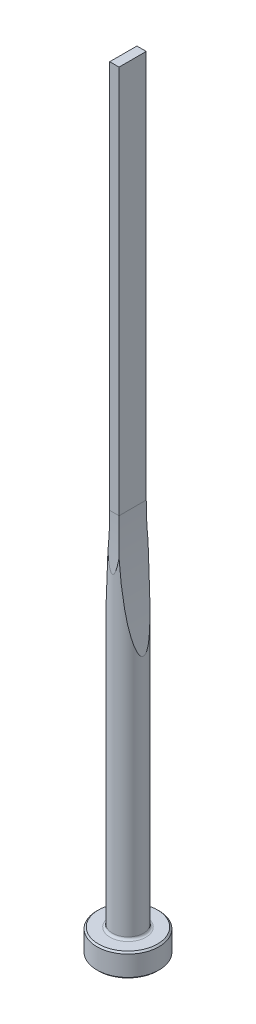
ISO-10303-21;
HEADER;
FILE_DESCRIPTION(('STEP AP214'),'2;1');
FILE_NAME('part.step','',(''),(''),'','','');
FILE_SCHEMA(('AUTOMOTIVE_DESIGN { 1 0 10303 214 1 1 1 1 }'));
ENDSEC;
DATA;
#1=APPLICATION_CONTEXT('core data for automotive mechanical design processes');
#2=APPLICATION_PROTOCOL_DEFINITION('international standard','automotive_design',2000,#1);
#3=PRODUCT_CONTEXT('',#1,'mechanical');
#4=PRODUCT('Part','Part','',(#3));
#5=PRODUCT_RELATED_PRODUCT_CATEGORY('part','',(#4));
#6=PRODUCT_DEFINITION_FORMATION('','',#4);
#7=PRODUCT_DEFINITION_CONTEXT('part definition',#1,'design');
#8=PRODUCT_DEFINITION('design','',#6,#7);
#9=PRODUCT_DEFINITION_SHAPE('','',#8);
#10=(LENGTH_UNIT() NAMED_UNIT(*) SI_UNIT(.MILLI.,.METRE.));
#11=(NAMED_UNIT(*) PLANE_ANGLE_UNIT() SI_UNIT($,.RADIAN.));
#12=(NAMED_UNIT(*) SI_UNIT($,.STERADIAN.) SOLID_ANGLE_UNIT());
#13=UNCERTAINTY_MEASURE_WITH_UNIT(LENGTH_MEASURE(1.E-05),#10,'distance_accuracy_value','');
#14=(GEOMETRIC_REPRESENTATION_CONTEXT(3) GLOBAL_UNCERTAINTY_ASSIGNED_CONTEXT((#13)) GLOBAL_UNIT_ASSIGNED_CONTEXT((#10,
#11,#12)) REPRESENTATION_CONTEXT('',''));
#15=CARTESIAN_POINT('',(0.,0.,0.));
#16=DIRECTION('',(0.,0.,1.));
#17=DIRECTION('',(1.,0.,0.));
#18=AXIS2_PLACEMENT_3D('',#15,#16,#17);
#19=CARTESIAN_POINT('',(0.,0.,0.));
#20=DIRECTION('',(0.,1.,0.));
#21=DIRECTION('',(-1.,0.,0.));
#22=AXIS2_PLACEMENT_3D('',#19,#20,#21);
#23=PLANE('',#22);
#24=CARTESIAN_POINT('',(0.,0.,0.));
#25=DIRECTION('',(0.,1.,0.));
#26=DIRECTION('',(-1.,0.,0.));
#27=AXIS2_PLACEMENT_3D('',#24,#25,#26);
#28=CIRCLE('',#27,3.8);
#29=CARTESIAN_POINT('',(-3.8,0.,0.));
#30=VERTEX_POINT('',#29);
#31=EDGE_CURVE('E133',#30,#30,#28,.T.);
#32=ORIENTED_EDGE('',*,*,#31,.F.);
#33=EDGE_LOOP('',(#32));
#34=FACE_BOUND('',#33,.T.);
#35=ADVANCED_FACE('F32',(#34),#23,.F.);
#36=CARTESIAN_POINT('',(0.,0.,0.));
#37=DIRECTION('',(0.,1.,0.));
#38=DIRECTION('',(-1.,0.,0.));
#39=AXIS2_PLACEMENT_3D('',#36,#37,#38);
#40=CONICAL_SURFACE('',#39,3.8,0.785398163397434);
#41=CARTESIAN_POINT('',(0.,0.200000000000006,0.));
#42=DIRECTION('',(0.,1.,0.));
#43=DIRECTION('',(-1.,0.,0.));
#44=AXIS2_PLACEMENT_3D('',#41,#42,#43);
#45=CIRCLE('',#44,4.);
#46=CARTESIAN_POINT('',(-4.,0.200000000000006,0.));
#47=VERTEX_POINT('',#46);
#48=EDGE_CURVE('E130',#47,#47,#45,.T.);
#49=ORIENTED_EDGE('',*,*,#48,.F.);
#50=EDGE_LOOP('',(#49));
#51=FACE_BOUND('',#50,.T.);
#52=ORIENTED_EDGE('',*,*,#31,.T.);
#53=EDGE_LOOP('',(#52));
#54=FACE_BOUND('',#53,.T.);
#55=ADVANCED_FACE('F171',(#51,#54),#40,.T.);
#56=CARTESIAN_POINT('',(0.,100.,0.));
#57=DIRECTION('',(0.,1.,0.));
#58=DIRECTION('',(-1.,0.,0.));
#59=AXIS2_PLACEMENT_3D('',#56,#57,#58);
#60=CYLINDRICAL_SURFACE('',#59,4.);
#61=CARTESIAN_POINT('',(0.,2.8,0.));
#62=DIRECTION('',(0.,1.,0.));
#63=DIRECTION('',(-1.,0.,0.));
#64=AXIS2_PLACEMENT_3D('',#61,#62,#63);
#65=CIRCLE('',#64,4.);
#66=CARTESIAN_POINT('',(-4.,2.8,0.));
#67=VERTEX_POINT('',#66);
#68=EDGE_CURVE('E127',#67,#67,#65,.T.);
#69=ORIENTED_EDGE('',*,*,#68,.F.);
#70=EDGE_LOOP('',(#69));
#71=FACE_BOUND('',#70,.T.);
#72=ORIENTED_EDGE('',*,*,#48,.T.);
#73=EDGE_LOOP('',(#72));
#74=FACE_BOUND('',#73,.T.);
#75=ADVANCED_FACE('F176',(#71,#74),#60,.T.);
#76=CARTESIAN_POINT('',(0.,2.8,0.));
#77=DIRECTION('',(0.,-1.,0.));
#78=DIRECTION('',(1.,0.,0.));
#79=AXIS2_PLACEMENT_3D('',#76,#77,#78);
#80=CONICAL_SURFACE('',#79,4.,0.785398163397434);
#81=CARTESIAN_POINT('',(0.,3.,0.));
#82=DIRECTION('',(0.,1.,0.));
#83=DIRECTION('',(-1.,0.,0.));
#84=AXIS2_PLACEMENT_3D('',#81,#82,#83);
#85=CIRCLE('',#84,3.8);
#86=CARTESIAN_POINT('',(-3.8,3.,0.));
#87=VERTEX_POINT('',#86);
#88=EDGE_CURVE('E124',#87,#87,#85,.T.);
#89=ORIENTED_EDGE('',*,*,#88,.F.);
#90=EDGE_LOOP('',(#89));
#91=FACE_BOUND('',#90,.T.);
#92=ORIENTED_EDGE('',*,*,#68,.T.);
#93=EDGE_LOOP('',(#92));
#94=FACE_BOUND('',#93,.T.);
#95=ADVANCED_FACE('F183',(#91,#94),#80,.T.);
#96=CARTESIAN_POINT('',(3.8,3.,0.));
#97=DIRECTION('',(0.,-1.,0.));
#98=DIRECTION('',(1.,0.,0.));
#99=AXIS2_PLACEMENT_3D('',#96,#97,#98);
#100=PLANE('',#99);
#101=CARTESIAN_POINT('',(0.,3.,0.));
#102=DIRECTION('',(0.,1.,0.));
#103=DIRECTION('',(-1.,0.,0.));
#104=AXIS2_PLACEMENT_3D('',#101,#102,#103);
#105=CIRCLE('',#104,2.30000000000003);
#106=CARTESIAN_POINT('',(-2.30000000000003,3.,0.));
#107=VERTEX_POINT('',#106);
#108=EDGE_CURVE('E121',#107,#107,#105,.T.);
#109=ORIENTED_EDGE('',*,*,#108,.F.);
#110=EDGE_LOOP('',(#109));
#111=FACE_BOUND('',#110,.T.);
#112=ORIENTED_EDGE('',*,*,#88,.T.);
#113=EDGE_LOOP('',(#112));
#114=FACE_BOUND('',#113,.T.);
#115=ADVANCED_FACE('F190',(#111,#114),#100,.F.);
#116=CARTESIAN_POINT('',(0.,3.3,0.));
#117=DIRECTION('',(0.,1.,0.));
#118=DIRECTION('',(-1.,0.,0.));
#119=AXIS2_PLACEMENT_3D('',#116,#117,#118);
#120=TOROIDAL_SURFACE('',#119,2.30000000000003,0.3);
#121=CARTESIAN_POINT('',(0.,3.3,0.));
#122=DIRECTION('',(0.,1.,0.));
#123=DIRECTION('',(-1.,0.,0.));
#124=AXIS2_PLACEMENT_3D('',#121,#122,#123);
#125=CIRCLE('',#124,2.00000000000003);
#126=CARTESIAN_POINT('',(-2.00000000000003,3.3,0.));
#127=VERTEX_POINT('',#126);
#128=EDGE_CURVE('E112',#127,#127,#125,.T.);
#129=ORIENTED_EDGE('',*,*,#128,.F.);
#130=EDGE_LOOP('',(#129));
#131=FACE_BOUND('',#130,.T.);
#132=ORIENTED_EDGE('',*,*,#108,.T.);
#133=EDGE_LOOP('',(#132));
#134=FACE_BOUND('',#133,.T.);
#135=ADVANCED_FACE('F168',(#131,#134),#120,.F.);
#136=CARTESIAN_POINT('',(0.,100.,0.));
#137=DIRECTION('',(0.,1.,0.));
#138=DIRECTION('',(-1.,0.,0.));
#139=AXIS2_PLACEMENT_3D('',#136,#137,#138);
#140=CYLINDRICAL_SURFACE('',#139,2.00000000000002);
#141=CARTESIAN_POINT('',(2.00000000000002,34.1873468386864,0.));
#142=CARTESIAN_POINT('',(1.99999944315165,34.1873499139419,0.0216472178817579));
#143=CARTESIAN_POINT('',(1.99964397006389,34.1893413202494,0.0433096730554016));
#144=CARTESIAN_POINT('',(1.99826730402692,34.1970579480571,0.0859399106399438));
#145=CARTESIAN_POINT('',(1.99724503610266,34.2027891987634,0.106906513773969));
#146=CARTESIAN_POINT('',(1.99426681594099,34.2195013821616,0.153609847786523));
#147=CARTESIAN_POINT('',(1.99212558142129,34.2315254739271,0.178955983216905));
#148=CARTESIAN_POINT('',(1.98718006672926,34.2593410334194,0.227401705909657));
#149=CARTESIAN_POINT('',(1.98437426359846,34.2751411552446,0.25049595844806));
#150=CARTESIAN_POINT('',(1.97595589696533,34.3226359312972,0.311725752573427));
#151=CARTESIAN_POINT('',(1.96985781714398,34.3571338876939,0.34758704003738));
#152=CARTESIAN_POINT('',(1.95692929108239,34.4305609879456,0.414215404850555));
#153=CARTESIAN_POINT('',(1.95009663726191,34.469503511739,0.444966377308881));
#154=CARTESIAN_POINT('',(1.93197736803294,34.5732088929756,0.51929798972));
#155=CARTESIAN_POINT('',(1.92039337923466,34.6399173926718,0.560058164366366));
#156=CARTESIAN_POINT('',(1.89680281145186,34.7767388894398,0.635355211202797));
#157=CARTESIAN_POINT('',(1.88479527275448,34.8468597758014,0.669876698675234));
#158=CARTESIAN_POINT('',(1.86054677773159,34.9895135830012,0.734549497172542));
#159=CARTESIAN_POINT('',(1.84830489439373,35.0620577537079,0.764675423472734));
#160=CARTESIAN_POINT('',(1.82380103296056,35.2083807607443,0.821400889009));
#161=CARTESIAN_POINT('',(1.81153909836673,35.2821579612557,0.848004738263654));
#162=CARTESIAN_POINT('',(1.78582662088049,35.4380819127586,0.900985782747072));
#163=CARTESIAN_POINT('',(1.77238000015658,35.5203270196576,0.92707355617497));
#164=CARTESIAN_POINT('',(1.74559054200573,35.6856387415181,0.976576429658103));
#165=CARTESIAN_POINT('',(1.73224771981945,35.7687054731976,0.999991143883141));
#166=CARTESIAN_POINT('',(1.69242136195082,36.0189065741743,1.06697208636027));
#167=CARTESIAN_POINT('',(1.66615410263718,36.1869560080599,1.10724721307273));
#168=CARTESIAN_POINT('',(1.61431285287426,36.5249557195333,1.18153771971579));
#169=CARTESIAN_POINT('',(1.58874078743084,36.694909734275,1.21553698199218));
#170=CARTESIAN_POINT('',(1.53845319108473,37.035797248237,1.27858767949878));
#171=CARTESIAN_POINT('',(1.51373740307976,37.2067304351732,1.30764061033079));
#172=CARTESIAN_POINT('',(1.46519690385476,37.5494239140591,1.36180697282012));
#173=CARTESIAN_POINT('',(1.44137262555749,37.7211845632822,1.38691850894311));
#174=CARTESIAN_POINT('',(1.3946595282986,38.0652866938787,1.43388308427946));
#175=CARTESIAN_POINT('',(1.37177077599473,38.2376282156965,1.45573589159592));
#176=CARTESIAN_POINT('',(1.32698768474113,38.5824932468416,1.49667037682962));
#177=CARTESIAN_POINT('',(1.30509187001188,38.7550160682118,1.51575626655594));
#178=CARTESIAN_POINT('',(1.26227336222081,39.100418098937,1.55159369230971));
#179=CARTESIAN_POINT('',(1.24135064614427,39.2732972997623,1.56834528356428));
#180=CARTESIAN_POINT('',(1.18037596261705,39.7896932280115,1.61534740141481));
#181=CARTESIAN_POINT('',(1.14176915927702,40.1336505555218,1.64265239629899));
#182=CARTESIAN_POINT('',(1.0684863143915,40.8224172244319,1.69122983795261));
#183=CARTESIAN_POINT('',(1.03381053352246,41.1672266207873,1.71250188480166));
#184=CARTESIAN_POINT('',(0.968416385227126,41.8575525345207,1.75031306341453));
#185=CARTESIAN_POINT('',(0.937698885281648,42.2030691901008,1.76685115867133));
#186=CARTESIAN_POINT('',(0.880249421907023,42.8945977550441,1.7961621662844));
#187=CARTESIAN_POINT('',(0.853517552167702,43.2406096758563,1.8089349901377));
#188=CARTESIAN_POINT('',(0.804013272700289,43.9335662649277,1.83147591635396));
#189=CARTESIAN_POINT('',(0.781247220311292,44.2805115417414,1.84123921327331));
#190=CARTESIAN_POINT('',(0.739734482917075,44.9747044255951,1.85830327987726));
#191=CARTESIAN_POINT('',(0.720987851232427,45.3219520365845,1.86560401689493));
#192=CARTESIAN_POINT('',(0.670790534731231,46.3639465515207,1.88450374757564));
#193=CARTESIAN_POINT('',(0.645375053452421,47.0590483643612,1.89310332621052));
#194=CARTESIAN_POINT('',(0.610594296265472,48.452539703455,1.90459872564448));
#195=CARTESIAN_POINT('',(0.601295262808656,49.1509310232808,1.90747101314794));
#196=CARTESIAN_POINT('',(0.598956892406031,50.5477787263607,1.90820648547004));
#197=CARTESIAN_POINT('',(0.605918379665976,51.2462351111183,1.90606941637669));
#198=CARTESIAN_POINT('',(0.636076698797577,52.6417548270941,1.89622570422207));
#199=CARTESIAN_POINT('',(0.659249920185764,53.3388187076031,1.8885271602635));
#200=CARTESIAN_POINT('',(0.706149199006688,54.3837376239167,1.87125979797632));
#201=CARTESIAN_POINT('',(0.723804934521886,54.7319223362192,1.86455099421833));
#202=CARTESIAN_POINT('',(0.763157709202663,55.4280089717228,1.84879548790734));
#203=CARTESIAN_POINT('',(0.784854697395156,55.7759108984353,1.83974881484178));
#204=CARTESIAN_POINT('',(0.832297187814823,56.4715648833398,1.81877818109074));
#205=CARTESIAN_POINT('',(0.858045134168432,56.8193167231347,1.80685248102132));
#206=CARTESIAN_POINT('',(0.913570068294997,57.5143753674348,1.77942408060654));
#207=CARTESIAN_POINT('',(0.943347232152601,57.8616821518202,1.76392122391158));
#208=CARTESIAN_POINT('',(1.00698958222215,58.556547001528,1.72838264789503));
#209=CARTESIAN_POINT('',(1.04086452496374,58.9041036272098,1.70833600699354));
#210=CARTESIAN_POINT('',(1.11260945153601,59.598369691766,1.66250214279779));
#211=CARTESIAN_POINT('',(1.15047874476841,59.9450792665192,1.63671591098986));
#212=CARTESIAN_POINT('',(1.22972508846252,60.6335629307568,1.57803596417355));
#213=CARTESIAN_POINT('',(1.27105819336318,60.9753488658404,1.5452249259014));
#214=CARTESIAN_POINT('',(1.33590396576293,61.4869819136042,1.48868178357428));
#215=CARTESIAN_POINT('',(1.35800214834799,61.6574138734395,1.46860431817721));
#216=CARTESIAN_POINT('',(1.40312468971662,61.9977873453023,1.42555852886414));
#217=CARTESIAN_POINT('',(1.42614901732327,62.1677288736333,1.40259030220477));
#218=CARTESIAN_POINT('',(1.47300612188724,62.5063207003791,1.35329421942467));
#219=CARTESIAN_POINT('',(1.49683536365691,62.6749734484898,1.32697992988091));
#220=CARTESIAN_POINT('',(1.54534673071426,63.0114416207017,1.27015851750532));
#221=CARTESIAN_POINT('',(1.57002877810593,63.1792571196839,1.23965177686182));
#222=CARTESIAN_POINT('',(1.62015526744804,63.5135401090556,1.17338070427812));
#223=CARTESIAN_POINT('',(1.64559882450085,63.6800088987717,1.13762229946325));
#224=CARTESIAN_POINT('',(1.69716146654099,64.0111861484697,1.05918302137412));
#225=CARTESIAN_POINT('',(1.72328027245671,64.1758952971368,1.01650497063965));
#226=CARTESIAN_POINT('',(1.75624402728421,64.3801514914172,0.956968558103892));
#227=CARTESIAN_POINT('',(1.76287803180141,64.4210773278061,0.944702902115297));
#228=CARTESIAN_POINT('',(1.77616820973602,64.502710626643,0.919472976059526));
#229=CARTESIAN_POINT('',(1.78282438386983,64.5434180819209,0.906508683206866));
#230=CARTESIAN_POINT('',(1.80282568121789,64.665217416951,0.866438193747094));
#231=CARTESIAN_POINT('',(1.81619465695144,64.7459309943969,0.838170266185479));
#232=CARTESIAN_POINT('',(1.842992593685,64.9063844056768,0.777487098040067));
#233=CARTESIAN_POINT('',(1.85642139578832,64.9861147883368,0.74504663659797));
#234=CARTESIAN_POINT('',(1.88308902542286,65.1431838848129,0.674834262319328));
#235=CARTESIAN_POINT('',(1.8963280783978,65.2205255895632,0.637069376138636));
#236=CARTESIAN_POINT('',(1.91590815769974,65.3340592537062,0.574264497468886));
#237=CARTESIAN_POINT('',(1.92244199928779,65.3717962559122,0.55209068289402));
#238=CARTESIAN_POINT('',(1.9352857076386,65.4457062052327,0.505234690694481));
#239=CARTESIAN_POINT('',(1.94159573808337,65.4818802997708,0.480554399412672));
#240=CARTESIAN_POINT('',(1.95378896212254,65.5515435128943,0.428278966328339));
#241=CARTESIAN_POINT('',(1.95967602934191,65.5850574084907,0.400718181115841));
#242=CARTESIAN_POINT('',(1.97083927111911,65.6484149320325,0.341608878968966));
#243=CARTESIAN_POINT('',(1.97611767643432,65.6782719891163,0.310075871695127));
#244=CARTESIAN_POINT('',(1.98370934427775,65.72111006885,0.255577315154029));
#245=CARTESIAN_POINT('',(1.98636418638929,65.7360647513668,0.234229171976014));
#246=CARTESIAN_POINT('',(1.99112230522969,65.7628353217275,0.189564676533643));
#247=CARTESIAN_POINT('',(1.99322623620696,65.7746549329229,0.166250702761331));
#248=CARTESIAN_POINT('',(1.99634388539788,65.7921558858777,0.12245702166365));
#249=CARTESIAN_POINT('',(1.99748914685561,65.7985788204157,0.102287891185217));
#250=CARTESIAN_POINT('',(1.99917092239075,65.8080077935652,0.0611388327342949));
#251=CARTESIAN_POINT('',(1.99970807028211,65.8110173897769,0.0401597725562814));
#252=CARTESIAN_POINT('',(2.00011076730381,65.8132738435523,-0.00209050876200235));
#253=CARTESIAN_POINT('',(1.99997384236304,65.8125068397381,-0.0233625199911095));
#254=CARTESIAN_POINT('',(1.99904049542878,65.8072762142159,-0.0654312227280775));
#255=CARTESIAN_POINT('',(1.99824356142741,65.8028097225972,-0.0862275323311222));
#256=CARTESIAN_POINT('',(1.99583038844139,65.7892743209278,-0.131477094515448));
#257=CARTESIAN_POINT('',(1.99406797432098,65.7793837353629,-0.155672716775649));
#258=CARTESIAN_POINT('',(1.989895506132,65.7559361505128,-0.202147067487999));
#259=CARTESIAN_POINT('',(1.98748403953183,65.7423711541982,-0.22442147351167));
#260=CARTESIAN_POINT('',(1.98036787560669,65.7022752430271,-0.281918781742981));
#261=CARTESIAN_POINT('',(1.97523575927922,65.6732940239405,-0.315354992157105));
#262=CARTESIAN_POINT('',(1.96425111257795,65.611054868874,-0.377785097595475));
#263=CARTESIAN_POINT('',(1.95839645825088,65.5777843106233,-0.406765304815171));
#264=CARTESIAN_POINT('',(1.94334688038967,65.4919511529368,-0.474476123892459));
#265=CARTESIAN_POINT('',(1.93390458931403,65.4378330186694,-0.511154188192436));
#266=CARTESIAN_POINT('',(1.91458344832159,65.3264515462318,-0.579322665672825));
#267=CARTESIAN_POINT('',(1.90470363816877,65.2691812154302,-0.610800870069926));
#268=CARTESIAN_POINT('',(1.8846782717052,65.152399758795,-0.670052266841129));
#269=CARTESIAN_POINT('',(1.87453152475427,65.0928777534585,-0.697803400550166));
#270=CARTESIAN_POINT('',(1.8541587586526,64.972621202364,-0.750253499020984));
#271=CARTESIAN_POINT('',(1.84393284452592,64.9118881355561,-0.774955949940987));
#272=CARTESIAN_POINT('',(1.81265349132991,64.724922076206,-0.84681355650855));
#273=CARTESIAN_POINT('',(1.7915663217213,64.597228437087,-0.890140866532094));
#274=CARTESIAN_POINT('',(1.74961440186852,64.339667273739,-0.969977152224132));
#275=CARTESIAN_POINT('',(1.72874981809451,64.2097982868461,-1.00648132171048));
#276=CARTESIAN_POINT('',(1.68734558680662,63.9483846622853,-1.07445409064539));
#277=CARTESIAN_POINT('',(1.66680678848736,63.8168368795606,-1.10591102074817));
#278=CARTESIAN_POINT('',(1.62618292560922,63.5527756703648,-1.16481986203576));
#279=CARTESIAN_POINT('',(1.60609790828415,63.4202621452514,-1.19227135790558));
#280=CARTESIAN_POINT('',(1.56642480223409,63.154487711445,-1.24393463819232));
#281=CARTESIAN_POINT('',(1.54683688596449,63.0212265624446,-1.26814531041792));
#282=CARTESIAN_POINT('',(1.50819540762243,62.7541586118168,-1.31386508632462));
#283=CARTESIAN_POINT('',(1.48914188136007,62.6203517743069,-1.33537400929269));
#284=CARTESIAN_POINT('',(1.45162056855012,62.3525180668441,-1.37606771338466));
#285=CARTESIAN_POINT('',(1.43315193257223,62.218491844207,-1.39525599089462));
#286=CARTESIAN_POINT('',(1.39678562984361,61.9500998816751,-1.43165988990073));
#287=CARTESIAN_POINT('',(1.37888794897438,61.8157341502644,-1.44887556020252));
#288=CARTESIAN_POINT('',(1.32640652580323,61.4148014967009,-1.49763894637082));
#289=CARTESIAN_POINT('',(1.29267273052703,61.1478174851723,-1.52668404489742));
#290=CARTESIAN_POINT('',(1.22754352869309,60.6130391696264,-1.57952103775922));
#291=CARTESIAN_POINT('',(1.19614828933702,60.3452448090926,-1.60331255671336));
#292=CARTESIAN_POINT('',(1.13572436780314,59.8089860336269,-1.64666742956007));
#293=CARTESIAN_POINT('',(1.10669624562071,59.5405214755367,-1.6662297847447));
#294=CARTESIAN_POINT('',(1.05103593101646,59.00311173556,-1.70188420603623));
#295=CARTESIAN_POINT('',(1.02440379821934,58.7341665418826,-1.71797618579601));
#296=CARTESIAN_POINT('',(0.948042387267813,57.9258895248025,-1.76201745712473));
#297=CARTESIAN_POINT('',(0.901945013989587,57.3859760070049,-1.78566679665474));
#298=CARTESIAN_POINT('',(0.819500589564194,56.3052077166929,-1.82495988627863));
#299=CARTESIAN_POINT('',(0.783152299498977,55.764353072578,-1.84060465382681));
#300=CARTESIAN_POINT('',(0.720108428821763,54.6798749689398,-1.86617389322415));
#301=CARTESIAN_POINT('',(0.693450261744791,54.1362488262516,-1.87607627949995));
#302=CARTESIAN_POINT('',(0.649998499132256,53.0485250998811,-1.89156826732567));
#303=CARTESIAN_POINT('',(0.633205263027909,52.5044274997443,-1.89715771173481));
#304=CARTESIAN_POINT('',(0.609510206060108,51.4167642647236,-1.9049020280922));
#305=CARTESIAN_POINT('',(0.602594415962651,50.8731989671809,-1.90706175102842));
#306=CARTESIAN_POINT('',(0.598612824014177,49.7860467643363,-1.90831518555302));
#307=CARTESIAN_POINT('',(0.601546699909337,49.2424598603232,-1.90740899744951));
#308=CARTESIAN_POINT('',(0.617288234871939,48.1536536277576,-1.90237333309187));
#309=CARTESIAN_POINT('',(0.630128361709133,47.6084348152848,-1.89823325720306));
#310=CARTESIAN_POINT('',(0.665716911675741,46.5183112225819,-1.88604805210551));
#311=CARTESIAN_POINT('',(0.688466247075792,45.9734064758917,-1.87800256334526));
#312=CARTESIAN_POINT('',(0.743949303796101,44.882437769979,-1.85672442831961));
#313=CARTESIAN_POINT('',(0.776715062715,44.3363757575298,-1.84347509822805));
#314=CARTESIAN_POINT('',(0.852169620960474,43.2453093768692,-1.80984321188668));
#315=CARTESIAN_POINT('',(0.894855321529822,42.7003047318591,-1.78946288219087));
#316=CARTESIAN_POINT('',(0.966016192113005,41.8869302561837,-1.75143121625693));
#317=CARTESIAN_POINT('',(0.990760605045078,41.6180501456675,-1.73761229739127));
#318=CARTESIAN_POINT('',(1.04265058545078,41.0806939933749,-1.70698331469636));
#319=CARTESIAN_POINT('',(1.06979610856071,40.8122179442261,-1.69017330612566));
#320=CARTESIAN_POINT('',(1.12650805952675,40.2754348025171,-1.65291628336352));
#321=CARTESIAN_POINT('',(1.15607743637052,40.0071283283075,-1.63246480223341));
#322=CARTESIAN_POINT('',(1.217581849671,39.4711790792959,-1.58712237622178));
#323=CARTESIAN_POINT('',(1.24951668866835,39.2035362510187,-1.56223180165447));
#324=CARTESIAN_POINT('',(1.31552850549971,38.6706208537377,-1.50705854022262));
#325=CARTESIAN_POINT('',(1.34959232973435,38.4053434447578,-1.47680718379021));
#326=CARTESIAN_POINT('',(1.41997608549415,37.8758647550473,-1.40927854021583));
#327=CARTESIAN_POINT('',(1.45629677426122,37.61166386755,-1.37199888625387));
#328=CARTESIAN_POINT('',(1.51233471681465,37.2169832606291,-1.30905331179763));
#329=CARTESIAN_POINT('',(1.53125365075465,37.0858246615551,-1.28692628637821));
#330=CARTESIAN_POINT('',(1.56959623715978,36.8240866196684,-1.23987603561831));
#331=CARTESIAN_POINT('',(1.589019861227,36.6935071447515,-1.21495296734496));
#332=CARTESIAN_POINT('',(1.62832581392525,36.4331834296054,-1.16174364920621));
#333=CARTESIAN_POINT('',(1.64820786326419,36.3034387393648,-1.13345940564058));
#334=CARTESIAN_POINT('',(1.68838528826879,36.0450060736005,-1.07270154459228));
#335=CARTESIAN_POINT('',(1.70868058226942,35.9163178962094,-1.04022874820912));
#336=CARTESIAN_POINT('',(1.73711894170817,35.7384807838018,-0.991295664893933));
#337=CARTESIAN_POINT('',(1.74512708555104,35.6886726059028,-0.977143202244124));
#338=CARTESIAN_POINT('',(1.76118450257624,35.589330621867,-0.94789680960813));
#339=CARTESIAN_POINT('',(1.76923378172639,35.5397968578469,-0.932802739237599));
#340=CARTESIAN_POINT('',(1.78535433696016,35.4411122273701,-0.901564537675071));
#341=CARTESIAN_POINT('',(1.7934255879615,35.3919610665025,-0.885421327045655));
#342=CARTESIAN_POINT('',(1.80958161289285,35.294080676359,-0.85191546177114));
#343=CARTESIAN_POINT('',(1.81766638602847,35.2453514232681,-0.834552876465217));
#344=CARTESIAN_POINT('',(1.83703615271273,35.1291911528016,-0.791243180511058));
#345=CARTESIAN_POINT('',(1.84831862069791,35.0620081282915,-0.764622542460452));
#346=CARTESIAN_POINT('',(1.8708152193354,34.9289574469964,-0.707805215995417));
#347=CARTESIAN_POINT('',(1.882029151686,34.8630929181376,-0.677600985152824));
#348=CARTESIAN_POINT('',(1.90503182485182,34.7288638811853,-0.610101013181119));
#349=CARTESIAN_POINT('',(1.91680157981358,34.6606758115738,-0.57244562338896));
#350=CARTESIAN_POINT('',(1.93966705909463,34.5290680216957,-0.489462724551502));
#351=CARTESIAN_POINT('',(1.95076550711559,34.4656287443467,-0.444169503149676));
#352=CARTESIAN_POINT('',(1.96512636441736,34.3839905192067,-0.37242318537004));
#353=CARTESIAN_POINT('',(1.96908728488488,34.361528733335,-0.351021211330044));
#354=CARTESIAN_POINT('',(1.97661389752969,34.3189318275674,-0.305821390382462));
#355=CARTESIAN_POINT('',(1.98017877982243,34.2988014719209,-0.282018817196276));
#356=CARTESIAN_POINT('',(1.98675124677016,34.2617502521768,-0.231270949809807));
#357=CARTESIAN_POINT('',(1.98974844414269,34.2448890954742,-0.204279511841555));
#358=CARTESIAN_POINT('',(1.9947553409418,34.2167548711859,-0.147472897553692));
#359=CARTESIAN_POINT('',(1.99677085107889,34.2054489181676,-0.117675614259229));
#360=CARTESIAN_POINT('',(1.99872806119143,34.1944749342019,-0.072736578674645));
#361=CARTESIAN_POINT('',(1.99920213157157,34.1918179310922,-0.0583277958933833));
#362=CARTESIAN_POINT('',(1.99983832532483,34.188252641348,-0.0292817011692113));
#363=CARTESIAN_POINT('',(2.0000003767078,34.1873447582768,-0.014644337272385));
#364=CARTESIAN_POINT('',(2.00000000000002,34.1873468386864,0.));
#365=B_SPLINE_CURVE_WITH_KNOTS('',3,(#141,#142,#143,#144,#145,#146,#147,#148,#149,#150,#151,
#152,#153,#154,#155,#156,#157,#158,#159,#160,#161,#162,#163,#164,#165,#166,#167,#168,#169,#170,
#171,#172,#173,#174,#175,#176,#177,#178,#179,#180,#181,#182,#183,#184,#185,#186,#187,#188,#189,
#190,#191,#192,#193,#194,#195,#196,#197,#198,#199,#200,#201,#202,#203,#204,#205,#206,#207,#208,
#209,#210,#211,#212,#213,#214,#215,#216,#217,#218,#219,#220,#221,#222,#223,#224,#225,#226,#227,
#228,#229,#230,#231,#232,#233,#234,#235,#236,#237,#238,#239,#240,#241,#242,#243,#244,#245,#246,
#247,#248,#249,#250,#251,#252,#253,#254,#255,#256,#257,#258,#259,#260,#261,#262,#263,#264,#265,
#266,#267,#268,#269,#270,#271,#272,#273,#274,#275,#276,#277,#278,#279,#280,#281,#282,#283,#284,
#285,#286,#287,#288,#289,#290,#291,#292,#293,#294,#295,#296,#297,#298,#299,#300,#301,#302,#303,
#304,#305,#306,#307,#308,#309,#310,#311,#312,#313,#314,#315,#316,#317,#318,#319,#320,#321,#322,
#323,#324,#325,#326,#327,#328,#329,#330,#331,#332,#333,#334,#335,#336,#337,#338,#339,#340,#341,
#342,#343,#344,#345,#346,#347,#348,#349,#350,#351,#352,#353,#354,#355,#356,#357,#358,#359,#360,
#361,#362,#363,#364),.UNSPECIFIED.,.T.,.F.,(4,2,2,2,2,2,2,2,2,2,2,2,2,2,2,2,2,2,2,2,2,2,2,2,2,2,
2,2,2,2,2,2,2,2,2,2,2,2,2,2,2,2,2,2,2,2,2,2,2,2,2,2,2,2,2,2,2,2,2,2,2,2,2,2,2,2,2,2,2,2,2,2,2,2,
2,2,2,2,2,2,2,2,2,2,2,2,2,2,2,2,2,2,2,2,2,2,2,2,2,2,2,2,2,2,2,2,2,2,2,2,2,4),(0.,
0.064880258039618,0.129865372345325,0.213789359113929,0.297907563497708,0.44746085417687,
0.597476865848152,0.83395465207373,1.07100786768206,1.30938006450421,1.54745781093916,
1.80937412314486,2.07132819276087,2.59551004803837,3.12101992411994,3.64637062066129,
4.17197320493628,4.69761317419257,5.22244441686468,5.74726324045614,6.78873702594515,
7.83027983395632,8.87205051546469,9.91384568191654,10.9572958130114,12.0007597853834,
14.0873772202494,16.1825509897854,18.2778309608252,20.3700657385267,21.4161303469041,
22.4621817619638,23.5088667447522,24.5555974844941,25.6048713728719,26.6539641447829,
27.6913291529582,28.2103901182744,28.7294336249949,29.2464360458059,29.7633913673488,
30.2797676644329,30.7959338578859,30.9256375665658,31.0553455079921,31.3149358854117,
31.5761763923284,31.8370753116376,31.9697689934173,32.1023635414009,32.2335261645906,
32.3641916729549,32.4425979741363,32.5209107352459,32.584247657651,32.6475185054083,
32.7110217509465,32.7745743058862,32.8527289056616,32.9310549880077,33.0639340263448,
33.1972134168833,33.3948757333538,33.592995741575,33.7922410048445,33.9912562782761,
34.4003734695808,34.8097777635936,35.2201153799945,35.6304955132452,36.0410161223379,
36.4515641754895,36.8614857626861,37.2713972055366,38.0833192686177,38.8952993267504,
39.7074709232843,40.5196627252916,42.146648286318,43.773426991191,45.4064215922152,
47.0394756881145,48.6702179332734,50.3009068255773,51.9369631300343,53.5731700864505,
55.2146662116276,56.8556502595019,57.666737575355,58.4778099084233,59.2898841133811,
60.10189060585,60.9092991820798,61.7169801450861,62.1200083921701,62.523014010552,
62.9257802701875,63.3284676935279,63.4856467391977,63.6428492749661,63.7999156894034,
63.9569731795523,64.1763229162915,64.396142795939,64.6322524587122,64.8673291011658,
64.9610317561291,65.0549226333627,65.1503934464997,65.2452920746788,65.2891734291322,
65.3330649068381),.UNSPECIFIED.);
#366=CARTESIAN_POINT('',(0.717042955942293,45.4115326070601,-1.86704295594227));
#367=VERTEX_POINT('',#366);
#368=CARTESIAN_POINT('',(0.717042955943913,45.4115326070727,1.86704295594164));
#369=VERTEX_POINT('',#368);
#370=EDGE_CURVE('E138',#367,#369,#365,.T.);
#371=ORIENTED_EDGE('',*,*,#370,.T.);
#372=CARTESIAN_POINT('',(-0.968245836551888,50.,1.75));
#373=CARTESIAN_POINT('',(-0.968238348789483,50.3335504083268,1.74999985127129));
#374=CARTESIAN_POINT('',(-0.96491383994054,50.6670930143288,1.75185441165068));
#375=CARTESIAN_POINT('',(-0.951335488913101,51.3339943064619,1.75926912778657));
#376=CARTESIAN_POINT('',(-0.941081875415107,51.6673529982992,1.76482916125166));
#377=CARTESIAN_POINT('',(-0.912720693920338,52.3344915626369,1.77966177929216));
#378=CARTESIAN_POINT('',(-0.89459357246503,52.6682704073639,1.78894360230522));
#379=CARTESIAN_POINT('',(-0.848686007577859,53.3349608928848,1.81119198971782));
#380=CARTESIAN_POINT('',(-0.820909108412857,53.6678728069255,1.82415720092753));
#381=CARTESIAN_POINT('',(-0.769005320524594,54.1665035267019,1.84634021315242));
#382=CARTESIAN_POINT('',(-0.749965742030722,54.3328098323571,1.85420260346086));
#383=CARTESIAN_POINT('',(-0.707487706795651,54.6649255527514,1.87082483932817));
#384=CARTESIAN_POINT('',(-0.684046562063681,54.8307346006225,1.87958523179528));
#385=CARTESIAN_POINT('',(-0.631397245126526,55.1606520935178,1.89792815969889));
#386=CARTESIAN_POINT('',(-0.602215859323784,55.3247648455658,1.90750676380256));
#387=CARTESIAN_POINT('',(-0.551786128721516,55.5694473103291,1.92245449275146));
#388=CARTESIAN_POINT('',(-0.533878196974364,55.6507164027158,1.92753077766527));
#389=CARTESIAN_POINT('',(-0.495093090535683,55.8125239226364,1.93785640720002));
#390=CARTESIAN_POINT('',(-0.474216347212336,55.8930624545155,1.94310572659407));
#391=CARTESIAN_POINT('',(-0.42829296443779,56.0530757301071,1.95374902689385));
#392=CARTESIAN_POINT('',(-0.40324234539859,56.132549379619,1.95914314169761));
#393=CARTESIAN_POINT('',(-0.360560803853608,56.2502226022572,1.9672829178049));
#394=CARTESIAN_POINT('',(-0.345421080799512,56.2893239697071,1.97001385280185));
#395=CARTESIAN_POINT('',(-0.312809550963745,56.366532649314,1.97545600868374));
#396=CARTESIAN_POINT('',(-0.295340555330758,56.4046410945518,1.97816724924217));
#397=CARTESIAN_POINT('',(-0.256751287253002,56.4796372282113,1.98354888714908));
#398=CARTESIAN_POINT('',(-0.235581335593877,56.5164989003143,1.98621810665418));
#399=CARTESIAN_POINT('',(-0.187728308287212,56.586387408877,1.99131986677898));
#400=CARTESIAN_POINT('',(-0.16112604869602,56.6194604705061,1.99375518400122));
#401=CARTESIAN_POINT('',(-0.120751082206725,56.6547640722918,1.99636953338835));
#402=CARTESIAN_POINT('',(-0.111560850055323,56.662036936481,1.9969091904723));
#403=CARTESIAN_POINT('',(-0.0922735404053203,56.675289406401,1.9978938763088));
#404=CARTESIAN_POINT('',(-0.0821773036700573,56.6812701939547,1.99833899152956));
#405=CARTESIAN_POINT('',(-0.0632207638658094,56.6903867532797,1.99901815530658));
#406=CARTESIAN_POINT('',(-0.0545231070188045,56.6938532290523,1.99927668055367));
#407=CARTESIAN_POINT('',(-0.0366717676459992,56.6993072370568,1.99968362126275));
#408=CARTESIAN_POINT('',(-0.0275187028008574,56.7012967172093,1.99983218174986));
#409=CARTESIAN_POINT('',(-0.0089311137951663,56.7035672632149,2.00000174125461));
#410=CARTESIAN_POINT('',(0.000504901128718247,56.703836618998,2.00002186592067));
#411=CARTESIAN_POINT('',(0.0192584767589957,56.7025973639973,1.99992930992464));
#412=CARTESIAN_POINT('',(0.0285759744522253,56.7010878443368,1.99981656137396));
#413=CARTESIAN_POINT('',(0.0479382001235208,56.6961998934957,1.99945173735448));
#414=CARTESIAN_POINT('',(0.0579283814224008,56.6926115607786,1.99918401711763));
#415=CARTESIAN_POINT('',(0.0771947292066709,56.6838760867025,1.99853304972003));
#416=CARTESIAN_POINT('',(0.0864694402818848,56.6787258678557,1.99814957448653));
#417=CARTESIAN_POINT('',(0.110056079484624,56.6635871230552,1.99702403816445));
#418=CARTESIAN_POINT('',(0.123732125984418,56.6526274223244,1.99621074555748));
#419=CARTESIAN_POINT('',(0.149379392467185,56.6288928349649,1.99445462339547));
#420=CARTESIAN_POINT('',(0.16134538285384,56.6161126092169,1.9935114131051));
#421=CARTESIAN_POINT('',(0.205772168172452,56.5638954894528,1.98967042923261));
#422=CARTESIAN_POINT('',(0.233384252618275,56.5204677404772,1.98650266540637));
#423=CARTESIAN_POINT('',(0.283063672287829,56.4305772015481,1.98001734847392));
#424=CARTESIAN_POINT('',(0.30508924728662,56.3840946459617,1.97669887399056));
#425=CARTESIAN_POINT('',(0.346614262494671,56.2871258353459,1.96985455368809));
#426=CARTESIAN_POINT('',(0.365923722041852,56.2365569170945,1.96632687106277));
#427=CARTESIAN_POINT('',(0.401868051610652,56.1344657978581,1.95929356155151));
#428=CARTESIAN_POINT('',(0.418500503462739,56.0829427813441,1.95578795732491));
#429=CARTESIAN_POINT('',(0.465545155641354,55.9272647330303,1.94533228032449));
#430=CARTESIAN_POINT('',(0.49302013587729,55.8222195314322,1.93845882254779));
#431=CARTESIAN_POINT('',(0.543128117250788,55.6109304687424,1.92501070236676));
#432=CARTESIAN_POINT('',(0.565757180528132,55.5046857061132,1.91843628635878));
#433=CARTESIAN_POINT('',(0.607474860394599,55.2916513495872,1.90563570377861));
#434=CARTESIAN_POINT('',(0.626568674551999,55.1848627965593,1.89940903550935));
#435=CARTESIAN_POINT('',(0.679606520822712,54.865588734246,1.88136685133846));
#436=CARTESIAN_POINT('',(0.709688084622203,54.6524380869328,1.87007721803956));
#437=CARTESIAN_POINT('',(0.762936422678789,54.2251827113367,1.84897871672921));
#438=CARTESIAN_POINT('',(0.786101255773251,54.0110777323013,1.83917026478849));
#439=CARTESIAN_POINT('',(0.827204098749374,53.5820289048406,1.82105456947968));
#440=CARTESIAN_POINT('',(0.845135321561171,53.3670843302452,1.81274928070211));
#441=CARTESIAN_POINT('',(0.876742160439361,52.9368251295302,1.79767146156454));
#442=CARTESIAN_POINT('',(0.890417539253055,52.7215104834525,1.79089901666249));
#443=CARTESIAN_POINT('',(0.92604238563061,52.0754331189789,1.77290217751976));
#444=CARTESIAN_POINT('',(0.942611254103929,51.6443036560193,1.76398841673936));
#445=CARTESIAN_POINT('',(0.964025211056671,50.7819612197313,1.75236444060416));
#446=CARTESIAN_POINT('',(0.968877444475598,50.3507484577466,1.74965044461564));
#447=CARTESIAN_POINT('',(0.967552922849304,49.5308621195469,1.75038346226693));
#448=CARTESIAN_POINT('',(0.962416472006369,49.1421864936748,1.75324937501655));
#449=CARTESIAN_POINT('',(0.942544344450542,48.3650984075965,1.76401153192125));
#450=CARTESIAN_POINT('',(0.927807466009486,47.9766859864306,1.77190840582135));
#451=CARTESIAN_POINT('',(0.887028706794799,47.2013181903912,1.79269108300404));
#452=CARTESIAN_POINT('',(0.861009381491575,46.814361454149,1.80556692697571));
#453=CARTESIAN_POINT('',(0.810327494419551,46.2349947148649,1.82857800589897));
#454=CARTESIAN_POINT('',(0.791485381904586,46.0420037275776,1.8368670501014));
#455=CARTESIAN_POINT('',(0.748852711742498,45.6566468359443,1.85465818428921));
#456=CARTESIAN_POINT('',(0.725062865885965,45.4642808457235,1.8641600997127));
#457=CARTESIAN_POINT('',(0.670881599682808,45.0804343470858,1.88435148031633));
#458=CARTESIAN_POINT('',(0.640488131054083,44.8889541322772,1.89504131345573));
#459=CARTESIAN_POINT('',(0.587350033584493,44.6032913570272,1.91189763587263));
#460=CARTESIAN_POINT('',(0.568392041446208,44.5083825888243,1.91764989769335));
#461=CARTESIAN_POINT('',(0.527121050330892,44.3193197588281,1.92940755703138));
#462=CARTESIAN_POINT('',(0.504809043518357,44.2251654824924,1.93541287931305));
#463=CARTESIAN_POINT('',(0.467684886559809,44.084717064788,1.94459011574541));
#464=CARTESIAN_POINT('',(0.454672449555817,44.037942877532,1.94768347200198));
#465=CARTESIAN_POINT('',(0.427105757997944,43.9448190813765,1.9539145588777));
#466=CARTESIAN_POINT('',(0.412550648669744,43.8984697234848,1.95705231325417));
#467=CARTESIAN_POINT('',(0.381456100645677,43.8064886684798,1.96334987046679));
#468=CARTESIAN_POINT('',(0.364918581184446,43.7608563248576,1.96650964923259));
#469=CARTESIAN_POINT('',(0.329109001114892,43.6706906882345,1.97282096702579));
#470=CARTESIAN_POINT('',(0.309839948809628,43.6261562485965,1.97597251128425));
#471=CARTESIAN_POINT('',(0.27187687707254,43.548760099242,1.98150517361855));
#472=CARTESIAN_POINT('',(0.254001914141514,43.5154988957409,1.98390223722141));
#473=CARTESIAN_POINT('',(0.214436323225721,43.4511543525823,1.98857376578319));
#474=CARTESIAN_POINT('',(0.1927494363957,43.4200689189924,1.99084834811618));
#475=CARTESIAN_POINT('',(0.15534493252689,43.3773052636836,1.9939967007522));
#476=CARTESIAN_POINT('',(0.14197230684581,43.3636268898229,1.99500731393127));
#477=CARTESIAN_POINT('',(0.113107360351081,43.3387364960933,1.99685119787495));
#478=CARTESIAN_POINT('',(0.0976304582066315,43.3275079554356,1.9976856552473));
#479=CARTESIAN_POINT('',(0.0728302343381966,43.3140179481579,1.99868989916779));
#480=CARTESIAN_POINT('',(0.0644176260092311,43.3101099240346,1.99898116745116));
#481=CARTESIAN_POINT('',(0.0470845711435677,43.3036295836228,1.99946443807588));
#482=CARTESIAN_POINT('',(0.0381646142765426,43.3010560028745,1.99965653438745));
#483=CARTESIAN_POINT('',(0.0199216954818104,43.2975044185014,1.99992169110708));
#484=CARTESIAN_POINT('',(0.0105959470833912,43.296540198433,1.99999372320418));
#485=CARTESIAN_POINT('',(-0.00807114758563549,43.2963827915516,2.00000547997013));
#486=CARTESIAN_POINT('',(-0.0174124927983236,43.297189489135,1.99994521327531));
#487=CARTESIAN_POINT('',(-0.0349517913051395,43.3003116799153,1.99971209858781));
#488=CARTESIAN_POINT('',(-0.0431765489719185,43.3024835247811,1.99954996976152));
#489=CARTESIAN_POINT('',(-0.0592195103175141,43.3079903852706,1.99913919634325));
#490=CARTESIAN_POINT('',(-0.0670374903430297,43.3113260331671,1.99889050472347));
#491=CARTESIAN_POINT('',(-0.0873820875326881,43.321521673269,1.9981311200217));
#492=CARTESIAN_POINT('',(-0.0994767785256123,43.3292325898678,1.99755750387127));
#493=CARTESIAN_POINT('',(-0.122375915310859,43.3463696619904,1.99628542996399));
#494=CARTESIAN_POINT('',(-0.133175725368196,43.3558016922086,1.99558654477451));
#495=CARTESIAN_POINT('',(-0.169137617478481,43.3907343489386,1.99300462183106));
#496=CARTESIAN_POINT('',(-0.19147258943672,43.4190676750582,1.99092143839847));
#497=CARTESIAN_POINT('',(-0.232121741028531,43.4784605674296,1.98658628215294));
#498=CARTESIAN_POINT('',(-0.250408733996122,43.5095367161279,1.98433329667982));
#499=CARTESIAN_POINT('',(-0.298259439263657,43.5991589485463,1.97788536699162));
#500=CARTESIAN_POINT('',(-0.324764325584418,43.6593227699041,1.97361381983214));
#501=CARTESIAN_POINT('',(-0.372968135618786,43.7815788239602,1.96506226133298));
#502=CARTESIAN_POINT('',(-0.394653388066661,43.8436759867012,1.96078225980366));
#503=CARTESIAN_POINT('',(-0.434799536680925,43.9690531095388,1.95227381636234));
#504=CARTESIAN_POINT('',(-0.453253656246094,44.0323352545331,1.94804549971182));
#505=CARTESIAN_POINT('',(-0.487767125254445,44.1594430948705,1.93968904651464));
#506=CARTESIAN_POINT('',(-0.503829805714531,44.2232679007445,1.93556077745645));
#507=CARTESIAN_POINT('',(-0.549032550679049,44.4141586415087,1.92341977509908));
#508=CARTESIAN_POINT('',(-0.57554736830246,44.5418548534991,1.9155683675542));
#509=CARTESIAN_POINT('',(-0.623901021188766,44.7981698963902,1.90036186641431));
#510=CARTESIAN_POINT('',(-0.645738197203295,44.9267890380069,1.89300694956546));
#511=CARTESIAN_POINT('',(-0.685944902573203,45.1847819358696,1.87881225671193));
#512=CARTESIAN_POINT('',(-0.704309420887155,45.3141565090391,1.87197323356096));
#513=CARTESIAN_POINT('',(-0.738276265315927,45.5732979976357,1.85883720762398));
#514=CARTESIAN_POINT('',(-0.753878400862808,45.7030649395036,1.85254024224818));
#515=CARTESIAN_POINT('',(-0.79726662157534,46.0924515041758,1.83449232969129));
#516=CARTESIAN_POINT('',(-0.82168275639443,46.3524855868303,1.82356626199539));
#517=CARTESIAN_POINT('',(-0.863851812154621,46.8729662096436,1.80396364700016));
#518=CARTESIAN_POINT('',(-0.881609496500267,47.1334123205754,1.79528549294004));
#519=CARTESIAN_POINT('',(-0.909188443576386,47.6109686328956,1.78145202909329));
#520=CARTESIAN_POINT('',(-0.919841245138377,47.8280215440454,1.77594999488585));
#521=CARTESIAN_POINT('',(-0.937831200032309,48.26233230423,1.76651427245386));
#522=CARTESIAN_POINT('',(-0.945167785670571,48.4795901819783,1.76258085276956));
#523=CARTESIAN_POINT('',(-0.962638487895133,49.1311260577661,1.75314663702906));
#524=CARTESIAN_POINT('',(-0.968255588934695,49.5655696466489,1.75000019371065));
#525=CARTESIAN_POINT('',(-0.968245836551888,50.,1.75));
#526=B_SPLINE_CURVE_WITH_KNOTS('',3,(#372,#373,#374,#375,#376,#377,#378,#379,#380,#381,#382,
#383,#384,#385,#386,#387,#388,#389,#390,#391,#392,#393,#394,#395,#396,#397,#398,#399,#400,#401,
#402,#403,#404,#405,#406,#407,#408,#409,#410,#411,#412,#413,#414,#415,#416,#417,#418,#419,#420,
#421,#422,#423,#424,#425,#426,#427,#428,#429,#430,#431,#432,#433,#434,#435,#436,#437,#438,#439,
#440,#441,#442,#443,#444,#445,#446,#447,#448,#449,#450,#451,#452,#453,#454,#455,#456,#457,#458,
#459,#460,#461,#462,#463,#464,#465,#466,#467,#468,#469,#470,#471,#472,#473,#474,#475,#476,#477,
#478,#479,#480,#481,#482,#483,#484,#485,#486,#487,#488,#489,#490,#491,#492,#493,#494,#495,#496,
#497,#498,#499,#500,#501,#502,#503,#504,#505,#506,#507,#508,#509,#510,#511,#512,#513,#514,#515,
#516,#517,#518,#519,#520,#521,#522,#523,#524,#525),.UNSPECIFIED.,.T.,.F.,(4,2,2,2,2,2,2,2,2,2,2,
2,2,2,2,2,2,2,2,2,2,2,2,2,2,2,2,2,2,2,2,2,2,2,2,2,2,2,2,2,2,2,2,2,2,2,2,2,2,2,2,2,2,2,2,2,2,2,2,
2,2,2,2,2,2,2,2,2,2,2,2,2,2,2,2,2,4),(0.,1.0006158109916,2.00119860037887,3.00428062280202,
4.00699461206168,4.50967978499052,5.01267294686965,5.51337234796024,5.76344921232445,
6.01348977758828,6.26377012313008,6.38978922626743,6.51565759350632,6.64336741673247,
6.76930011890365,6.80441740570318,6.83950243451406,6.86749611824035,6.89545281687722,
6.92359963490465,6.95176084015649,6.98343981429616,7.01518161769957,7.06751713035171,
7.12000941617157,7.27346664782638,7.42803926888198,7.59061961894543,7.75334601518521,
8.07950203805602,8.40592210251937,8.73185838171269,9.37833492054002,10.0249927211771,
10.6724854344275,11.3200142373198,12.6143689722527,13.9079341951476,15.0739514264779,
16.2401146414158,17.4039571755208,17.9861616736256,18.5682824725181,19.1505840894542,
19.4414102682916,19.7321505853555,19.8780790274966,20.0240887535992,20.1699582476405,
20.3156683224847,20.4290845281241,20.5423900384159,20.599712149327,20.6566348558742,
20.6843886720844,20.7121161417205,20.7400798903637,20.7680418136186,20.7934648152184,
20.8189016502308,20.8617157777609,20.9046788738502,21.0122552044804,21.120533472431,
21.3176552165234,21.5153291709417,21.7134128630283,21.911218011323,22.3030277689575,
22.6949762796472,23.0874861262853,23.4800230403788,24.264099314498,25.0476135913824,
25.6997303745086,26.3519587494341,27.6552036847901),.UNSPECIFIED.);
#527=CARTESIAN_POINT('',(-0.71704295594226,45.41153260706,1.86704295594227));
#528=VERTEX_POINT('',#527);
#529=EDGE_CURVE('E104',#369,#528,#526,.T.);
#530=ORIENTED_EDGE('',*,*,#529,.T.);
#531=CARTESIAN_POINT('',(-2.00000000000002,34.1873468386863,0.));
#532=CARTESIAN_POINT('',(-1.99999944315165,34.1873499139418,-0.0216472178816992));
#533=CARTESIAN_POINT('',(-1.99964397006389,34.1893413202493,-0.0433096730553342));
#534=CARTESIAN_POINT('',(-1.99826730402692,34.197057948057,-0.0859399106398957));
#535=CARTESIAN_POINT('',(-1.99724503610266,34.2027891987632,-0.106906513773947));
#536=CARTESIAN_POINT('',(-1.99426681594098,34.2195013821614,-0.15360984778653));
#537=CARTESIAN_POINT('',(-1.99212558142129,34.2315254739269,-0.178955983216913));
#538=CARTESIAN_POINT('',(-1.98718006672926,34.2593410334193,-0.227401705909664));
#539=CARTESIAN_POINT('',(-1.98437426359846,34.2751411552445,-0.250495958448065));
#540=CARTESIAN_POINT('',(-1.97595589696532,34.322635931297,-0.311725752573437));
#541=CARTESIAN_POINT('',(-1.96985781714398,34.3571338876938,-0.34758704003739));
#542=CARTESIAN_POINT('',(-1.95692929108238,34.4305609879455,-0.414215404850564));
#543=CARTESIAN_POINT('',(-1.95009663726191,34.4695035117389,-0.444966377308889));
#544=CARTESIAN_POINT('',(-1.93197736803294,34.5732088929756,-0.51929798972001));
#545=CARTESIAN_POINT('',(-1.92039337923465,34.6399173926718,-0.560058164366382));
#546=CARTESIAN_POINT('',(-1.89680281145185,34.7767388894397,-0.63535521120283));
#547=CARTESIAN_POINT('',(-1.88479527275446,34.8468597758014,-0.669876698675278));
#548=CARTESIAN_POINT('',(-1.86054677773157,34.9895135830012,-0.734549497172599));
#549=CARTESIAN_POINT('',(-1.8483048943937,35.0620577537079,-0.764675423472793));
#550=CARTESIAN_POINT('',(-1.82380103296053,35.2083807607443,-0.821400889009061));
#551=CARTESIAN_POINT('',(-1.8115390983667,35.2821579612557,-0.848004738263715));
#552=CARTESIAN_POINT('',(-1.78582662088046,35.4380819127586,-0.900985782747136));
#553=CARTESIAN_POINT('',(-1.77238000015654,35.5203270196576,-0.927073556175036));
#554=CARTESIAN_POINT('',(-1.74559054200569,35.6856387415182,-0.976576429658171));
#555=CARTESIAN_POINT('',(-1.73224771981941,35.7687054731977,-0.999991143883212));
#556=CARTESIAN_POINT('',(-1.69242136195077,36.0189065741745,-1.06697208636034));
#557=CARTESIAN_POINT('',(-1.66615410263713,36.1869560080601,-1.10724721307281));
#558=CARTESIAN_POINT('',(-1.61431285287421,36.5249557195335,-1.18153771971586));
#559=CARTESIAN_POINT('',(-1.58874078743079,36.6949097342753,-1.21553698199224));
#560=CARTESIAN_POINT('',(-1.53845319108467,37.0357972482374,-1.27858767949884));
#561=CARTESIAN_POINT('',(-1.5137374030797,37.2067304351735,-1.30764061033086));
#562=CARTESIAN_POINT('',(-1.46519690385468,37.5494239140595,-1.3618069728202));
#563=CARTESIAN_POINT('',(-1.44137262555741,37.7211845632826,-1.38691850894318));
#564=CARTESIAN_POINT('',(-1.39465952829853,38.0652866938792,-1.43388308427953));
#565=CARTESIAN_POINT('',(-1.37177077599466,38.237628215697,-1.45573589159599));
#566=CARTESIAN_POINT('',(-1.32698768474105,38.5824932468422,-1.49667037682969));
#567=CARTESIAN_POINT('',(-1.30509187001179,38.7550160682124,-1.51575626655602));
#568=CARTESIAN_POINT('',(-1.26227336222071,39.1004180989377,-1.55159369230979));
#569=CARTESIAN_POINT('',(-1.24135064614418,39.273297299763,-1.56834528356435));
#570=CARTESIAN_POINT('',(-1.18037596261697,39.7896932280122,-1.61534740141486));
#571=CARTESIAN_POINT('',(-1.14176915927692,40.1336505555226,-1.64265239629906));
#572=CARTESIAN_POINT('',(-1.06848631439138,40.8224172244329,-1.69122983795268));
#573=CARTESIAN_POINT('',(-1.03381053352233,41.1672266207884,-1.71250188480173));
#574=CARTESIAN_POINT('',(-0.968416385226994,41.8575525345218,-1.7503130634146));
#575=CARTESIAN_POINT('',(-0.937698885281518,42.203069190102,-1.76685115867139));
#576=CARTESIAN_POINT('',(-0.880249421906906,42.8945977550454,-1.79616216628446));
#577=CARTESIAN_POINT('',(-0.853517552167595,43.2406096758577,-1.80893499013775));
#578=CARTESIAN_POINT('',(-0.804013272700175,43.9335662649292,-1.83147591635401));
#579=CARTESIAN_POINT('',(-0.78124722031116,44.2805115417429,-1.84123921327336));
#580=CARTESIAN_POINT('',(-0.739734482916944,44.9747044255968,-1.85830327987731));
#581=CARTESIAN_POINT('',(-0.720987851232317,45.3219520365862,-1.86560401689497));
#582=CARTESIAN_POINT('',(-0.67079053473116,46.3639465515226,-1.88450374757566));
#583=CARTESIAN_POINT('',(-0.645375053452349,47.0590483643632,-1.89310332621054));
#584=CARTESIAN_POINT('',(-0.610594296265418,48.4525397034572,-1.9045987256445));
#585=CARTESIAN_POINT('',(-0.601295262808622,49.1509310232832,-1.90747101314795));
#586=CARTESIAN_POINT('',(-0.59895689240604,50.5477787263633,-1.90820648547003));
#587=CARTESIAN_POINT('',(-0.605918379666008,51.2462351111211,-1.90606941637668));
#588=CARTESIAN_POINT('',(-0.636076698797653,52.641754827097,-1.89622570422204));
#589=CARTESIAN_POINT('',(-0.659249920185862,53.3388187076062,-1.88852716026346));
#590=CARTESIAN_POINT('',(-0.706149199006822,54.38373762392,-1.87125979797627));
#591=CARTESIAN_POINT('',(-0.723804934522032,54.7319223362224,-1.86455099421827));
#592=CARTESIAN_POINT('',(-0.763157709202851,55.4280089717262,-1.84879548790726));
#593=CARTESIAN_POINT('',(-0.784854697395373,55.7759108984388,-1.83974881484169));
#594=CARTESIAN_POINT('',(-0.832297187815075,56.4715648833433,-1.81877818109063));
#595=CARTESIAN_POINT('',(-0.858045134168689,56.8193167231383,-1.80685248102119));
#596=CARTESIAN_POINT('',(-0.913570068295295,57.5143753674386,-1.77942408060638));
#597=CARTESIAN_POINT('',(-0.943347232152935,57.8616821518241,-1.7639212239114));
#598=CARTESIAN_POINT('',(-1.00698958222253,58.5565470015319,-1.72838264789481));
#599=CARTESIAN_POINT('',(-1.04086452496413,58.9041036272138,-1.7083360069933));
#600=CARTESIAN_POINT('',(-1.11260945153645,59.5983696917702,-1.66250214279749));
#601=CARTESIAN_POINT('',(-1.15047874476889,59.9450792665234,-1.63671591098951));
#602=CARTESIAN_POINT('',(-1.22972508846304,60.6335629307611,-1.57803596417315));
#603=CARTESIAN_POINT('',(-1.27105819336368,60.9753488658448,-1.54522492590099));
#604=CARTESIAN_POINT('',(-1.33590396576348,61.4869819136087,-1.48868178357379));
#605=CARTESIAN_POINT('',(-1.35800214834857,61.657413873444,-1.46860431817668));
#606=CARTESIAN_POINT('',(-1.40312468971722,61.9977873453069,-1.42555852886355));
#607=CARTESIAN_POINT('',(-1.42614901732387,62.1677288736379,-1.40259030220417));
#608=CARTESIAN_POINT('',(-1.47300612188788,62.5063207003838,-1.35329421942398));
#609=CARTESIAN_POINT('',(-1.49683536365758,62.6749734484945,-1.32697992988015));
#610=CARTESIAN_POINT('',(-1.54534673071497,63.0114416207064,-1.27015851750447));
#611=CARTESIAN_POINT('',(-1.57002877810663,63.1792571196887,-1.23965177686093));
#612=CARTESIAN_POINT('',(-1.62015526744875,63.5135401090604,-1.17338070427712));
#613=CARTESIAN_POINT('',(-1.64559882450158,63.6800088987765,-1.13762229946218));
#614=CARTESIAN_POINT('',(-1.69716146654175,64.0111861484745,-1.05918302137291));
#615=CARTESIAN_POINT('',(-1.72328027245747,64.1758952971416,-1.01650497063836));
#616=CARTESIAN_POINT('',(-1.75624402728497,64.380151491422,-0.956968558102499));
#617=CARTESIAN_POINT('',(-1.76287803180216,64.4210773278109,-0.944702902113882));
#618=CARTESIAN_POINT('',(-1.77616820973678,64.5027106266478,-0.919472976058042));
#619=CARTESIAN_POINT('',(-1.78282438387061,64.5434180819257,-0.906508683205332));
#620=CARTESIAN_POINT('',(-1.80282568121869,64.6652174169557,-0.866438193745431));
#621=CARTESIAN_POINT('',(-1.81619465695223,64.7459309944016,-0.838170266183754));
#622=CARTESIAN_POINT('',(-1.8429925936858,64.9063844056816,-0.777487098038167));
#623=CARTESIAN_POINT('',(-1.85642139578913,64.9861147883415,-0.745046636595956));
#624=CARTESIAN_POINT('',(-1.88308902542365,65.1431838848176,-0.674834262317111));
#625=CARTESIAN_POINT('',(-1.89632807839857,65.2205255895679,-0.637069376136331));
#626=CARTESIAN_POINT('',(-1.91590815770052,65.3340592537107,-0.57426449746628));
#627=CARTESIAN_POINT('',(-1.92244199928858,65.3717962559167,-0.552090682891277));
#628=CARTESIAN_POINT('',(-1.93528570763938,65.4457062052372,-0.505234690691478));
#629=CARTESIAN_POINT('',(-1.94159573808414,65.4818802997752,-0.480554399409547));
#630=CARTESIAN_POINT('',(-1.95378896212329,65.5515435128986,-0.42827896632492));
#631=CARTESIAN_POINT('',(-1.95967602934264,65.5850574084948,-0.400718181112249));
#632=CARTESIAN_POINT('',(-1.97083927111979,65.6484149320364,-0.341608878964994));
#633=CARTESIAN_POINT('',(-1.97611767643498,65.67827198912,-0.310075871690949));
#634=CARTESIAN_POINT('',(-1.98370934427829,65.7211100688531,-0.255577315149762));
#635=CARTESIAN_POINT('',(-1.98636418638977,65.7360647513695,-0.234229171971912));
#636=CARTESIAN_POINT('',(-1.99112230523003,65.7628353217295,-0.189564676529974));
#637=CARTESIAN_POINT('',(-1.99322623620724,65.7746549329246,-0.166250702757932));
#638=CARTESIAN_POINT('',(-1.99634388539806,65.7921558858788,-0.12245702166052));
#639=CARTESIAN_POINT('',(-1.99748914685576,65.7985788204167,-0.102287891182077));
#640=CARTESIAN_POINT('',(-1.99917092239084,65.8080077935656,-0.0611388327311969));
#641=CARTESIAN_POINT('',(-1.99970807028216,65.8110173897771,-0.0401597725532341));
#642=CARTESIAN_POINT('',(-2.0001107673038,65.8132738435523,0.00209050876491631));
#643=CARTESIAN_POINT('',(-1.999973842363,65.8125068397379,0.0233625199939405));
#644=CARTESIAN_POINT('',(-1.99904049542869,65.8072762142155,0.0654312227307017));
#645=CARTESIAN_POINT('',(-1.99824356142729,65.8028097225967,0.0862275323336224));
#646=CARTESIAN_POINT('',(-1.99583038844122,65.7892743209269,0.131477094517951));
#647=CARTESIAN_POINT('',(-1.99406797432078,65.7793837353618,0.155672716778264));
#648=CARTESIAN_POINT('',(-1.98989550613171,65.7559361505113,0.202147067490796));
#649=CARTESIAN_POINT('',(-1.9874840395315,65.7423711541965,0.224421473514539));
#650=CARTESIAN_POINT('',(-1.98036787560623,65.7022752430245,0.281918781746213));
#651=CARTESIAN_POINT('',(-1.97523575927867,65.6732940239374,0.31535499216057));
#652=CARTESIAN_POINT('',(-1.9642511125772,65.6110548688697,0.377785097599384));
#653=CARTESIAN_POINT('',(-1.95839645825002,65.5777843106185,0.406765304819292));
#654=CARTESIAN_POINT('',(-1.9433468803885,65.4919511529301,0.474476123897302));
#655=CARTESIAN_POINT('',(-1.93390458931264,65.4378330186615,0.511154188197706));
#656=CARTESIAN_POINT('',(-1.91458344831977,65.3264515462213,0.579322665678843));
#657=CARTESIAN_POINT('',(-1.90470363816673,65.2691812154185,0.610800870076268));
#658=CARTESIAN_POINT('',(-1.88467827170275,65.1523997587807,0.670052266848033));
#659=CARTESIAN_POINT('',(-1.87453152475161,65.0928777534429,0.697803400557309));
#660=CARTESIAN_POINT('',(-1.85415875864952,64.9726212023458,0.750253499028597));
#661=CARTESIAN_POINT('',(-1.84393284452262,64.9118881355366,0.77495594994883));
#662=CARTESIAN_POINT('',(-1.81265349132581,64.7249220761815,0.846813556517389));
#663=CARTESIAN_POINT('',(-1.79156632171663,64.5972284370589,0.890140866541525));
#664=CARTESIAN_POINT('',(-1.74961440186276,64.3396672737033,0.969977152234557));
#665=CARTESIAN_POINT('',(-1.72874981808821,64.2097982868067,1.0064813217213));
#666=CARTESIAN_POINT('',(-1.68734558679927,63.9483846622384,1.07445409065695));
#667=CARTESIAN_POINT('',(-1.66680678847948,63.8168368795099,1.10591102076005));
#668=CARTESIAN_POINT('',(-1.62618292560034,63.5527756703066,1.16481986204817));
#669=CARTESIAN_POINT('',(-1.60609790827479,63.4202621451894,1.1922713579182));
#670=CARTESIAN_POINT('',(-1.56642480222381,63.1544877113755,1.24393463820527));
#671=CARTESIAN_POINT('',(-1.54683688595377,63.0212265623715,1.268145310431));
#672=CARTESIAN_POINT('',(-1.50819540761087,62.7541586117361,1.31386508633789));
#673=CARTESIAN_POINT('',(-1.48914188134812,62.6203517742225,1.33537400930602));
#674=CARTESIAN_POINT('',(-1.45162056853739,62.3525180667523,1.37606771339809));
#675=CARTESIAN_POINT('',(-1.43315193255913,62.2184918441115,1.39525599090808));
#676=CARTESIAN_POINT('',(-1.39678562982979,61.9500998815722,1.43165988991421));
#677=CARTESIAN_POINT('',(-1.37888794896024,61.8157341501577,1.44887556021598));
#678=CARTESIAN_POINT('',(-1.3264065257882,61.4148014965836,1.49763894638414));
#679=CARTESIAN_POINT('',(-1.29267273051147,61.1478174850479,1.52668404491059));
#680=CARTESIAN_POINT('',(-1.22754352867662,60.6130391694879,1.57952103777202));
#681=CARTESIAN_POINT('',(-1.19614828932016,60.3452448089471,1.60331255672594));
#682=CARTESIAN_POINT('',(-1.13572436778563,59.8089860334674,1.64666742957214));
#683=CARTESIAN_POINT('',(-1.10669624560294,59.5405214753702,1.6662297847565));
#684=CARTESIAN_POINT('',(-1.05103593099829,59.0031117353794,1.70188420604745));
#685=CARTESIAN_POINT('',(-1.02440379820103,58.7341665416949,1.71797618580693));
#686=CARTESIAN_POINT('',(-0.948042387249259,57.9258895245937,1.76201745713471));
#687=CARTESIAN_POINT('',(-0.901945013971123,57.3859760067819,1.78566679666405));
#688=CARTESIAN_POINT('',(-0.819500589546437,56.3052077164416,1.82495988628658));
#689=CARTESIAN_POINT('',(-0.783152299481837,55.7643530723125,1.84060465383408));
#690=CARTESIAN_POINT('',(-0.720108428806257,54.6798749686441,1.86617389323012));
#691=CARTESIAN_POINT('',(-0.693450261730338,54.1362488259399,1.87607627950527));
#692=CARTESIAN_POINT('',(-0.649998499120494,53.0485250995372,1.89156826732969));
#693=CARTESIAN_POINT('',(-0.633205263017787,52.5044274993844,1.89715771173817));
#694=CARTESIAN_POINT('',(-0.609510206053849,51.416764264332,1.90490202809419));
#695=CARTESIAN_POINT('',(-0.602594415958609,50.8731989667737,1.90706175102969));
#696=CARTESIAN_POINT('',(-0.598612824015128,49.7860467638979,1.90831518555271));
#697=CARTESIAN_POINT('',(-0.601546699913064,49.2424598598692,1.90740899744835));
#698=CARTESIAN_POINT('',(-0.617288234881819,48.1536536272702,1.90237333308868));
#699=CARTESIAN_POINT('',(-0.630128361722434,47.6084348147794,1.89823325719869));
#700=CARTESIAN_POINT('',(-0.665716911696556,46.5183112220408,1.8860480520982));
#701=CARTESIAN_POINT('',(-0.6884662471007,45.9734064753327,1.87800256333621));
#702=CARTESIAN_POINT('',(-0.743949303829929,44.8824377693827,1.85672442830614));
#703=CARTESIAN_POINT('',(-0.776715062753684,44.3363757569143,1.84347509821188));
#704=CARTESIAN_POINT('',(-0.852169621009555,43.2453093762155,1.80984321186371));
#705=CARTESIAN_POINT('',(-0.894855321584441,42.7003047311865,1.78946288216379));
#706=CARTESIAN_POINT('',(-0.966016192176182,41.8869302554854,1.75143121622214));
#707=CARTESIAN_POINT('',(-0.990760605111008,41.6180501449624,1.73761229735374));
#708=CARTESIAN_POINT('',(-1.04265058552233,41.0806939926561,1.70698331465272));
#709=CARTESIAN_POINT('',(-1.06979610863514,40.8122179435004,1.69017330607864));
#710=CARTESIAN_POINT('',(-1.12650805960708,40.2754348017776,1.65291628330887));
#711=CARTESIAN_POINT('',(-1.15607743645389,40.0071283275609,1.63246480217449));
#712=CARTESIAN_POINT('',(-1.21758184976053,39.4711790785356,1.58712237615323));
#713=CARTESIAN_POINT('',(-1.24951668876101,39.2035362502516,1.56223180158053));
#714=CARTESIAN_POINT('',(-1.31552850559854,38.6706208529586,1.50705854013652));
#715=CARTESIAN_POINT('',(-1.3495923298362,38.4053434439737,1.47680718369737));
#716=CARTESIAN_POINT('',(-1.41997608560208,37.8758647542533,1.40927854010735));
#717=CARTESIAN_POINT('',(-1.45629677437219,37.6116638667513,1.37199888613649));
#718=CARTESIAN_POINT('',(-1.51233471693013,37.2169832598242,1.30905331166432));
#719=CARTESIAN_POINT('',(-1.53125365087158,37.0858246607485,1.28692628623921));
#720=CARTESIAN_POINT('',(-1.56959623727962,36.8240866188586,1.23987603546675));
#721=CARTESIAN_POINT('',(-1.58901986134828,36.6935071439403,1.21495296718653));
#722=CARTESIAN_POINT('',(-1.62832581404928,36.4331834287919,1.16174364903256));
#723=CARTESIAN_POINT('',(-1.64820786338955,36.3034387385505,1.13345940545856));
#724=CARTESIAN_POINT('',(-1.68838528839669,36.0450060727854,1.07270154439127));
#725=CARTESIAN_POINT('',(-1.70868058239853,35.9163178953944,1.04022874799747));
#726=CARTESIAN_POINT('',(-1.73711894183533,35.7384807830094,0.991295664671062));
#727=CARTESIAN_POINT('',(-1.74512708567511,35.6886726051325,0.977143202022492));
#728=CARTESIAN_POINT('',(-1.76118450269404,35.5893306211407,0.947896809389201));
#729=CARTESIAN_POINT('',(-1.76923378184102,35.5397968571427,0.932802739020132));
#730=CARTESIAN_POINT('',(-1.78535433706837,35.4411122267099,0.901564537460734));
#731=CARTESIAN_POINT('',(-1.79342558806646,35.3919610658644,0.885421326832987));
#732=CARTESIAN_POINT('',(-1.80958161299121,35.2940806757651,0.851915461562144));
#733=CARTESIAN_POINT('',(-1.81766638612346,35.2453514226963,0.834552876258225));
#734=CARTESIAN_POINT('',(-1.83703615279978,35.1291911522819,0.791243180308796));
#735=CARTESIAN_POINT('',(-1.84831862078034,35.0620081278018,0.764622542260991));
#736=CARTESIAN_POINT('',(-1.87081521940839,34.9289574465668,0.707805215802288));
#737=CARTESIAN_POINT('',(-1.88202915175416,34.8630929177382,0.677600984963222));
#738=CARTESIAN_POINT('',(-1.90503182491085,34.7288638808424,0.610101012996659));
#739=CARTESIAN_POINT('',(-1.91680157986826,34.6606758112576,0.572445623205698));
#740=CARTESIAN_POINT('',(-1.9396670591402,34.5290680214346,0.489462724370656));
#741=CARTESIAN_POINT('',(-1.9507655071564,34.4656287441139,0.444169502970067));
#742=CARTESIAN_POINT('',(-1.96512636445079,34.3839905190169,0.372423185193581));
#743=CARTESIAN_POINT('',(-1.96908728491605,34.3615287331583,0.351021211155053));
#744=CARTESIAN_POINT('',(-1.9766138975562,34.3189318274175,0.305821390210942));
#745=CARTESIAN_POINT('',(-1.98017877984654,34.2988014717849,0.282018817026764));
#746=CARTESIAN_POINT('',(-1.98675124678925,34.2617502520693,0.231270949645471));
#747=CARTESIAN_POINT('',(-1.98974844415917,34.2448890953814,0.204279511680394));
#748=CARTESIAN_POINT('',(-1.99475534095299,34.2167548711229,0.147472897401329));
#749=CARTESIAN_POINT('',(-1.99677085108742,34.2054489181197,0.117675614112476));
#750=CARTESIAN_POINT('',(-1.99872806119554,34.1944749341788,0.0727365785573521));
#751=CARTESIAN_POINT('',(-1.99920213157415,34.1918179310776,0.0583277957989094));
#752=CARTESIAN_POINT('',(-1.99983832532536,34.1882526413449,0.0292817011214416));
#753=CARTESIAN_POINT('',(-2.0000003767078,34.1873447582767,0.0146443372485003));
#754=CARTESIAN_POINT('',(-2.00000000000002,34.1873468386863,0.));
#755=B_SPLINE_CURVE_WITH_KNOTS('',3,(#531,#532,#533,#534,#535,#536,#537,#538,#539,#540,#541,
#542,#543,#544,#545,#546,#547,#548,#549,#550,#551,#552,#553,#554,#555,#556,#557,#558,#559,#560,
#561,#562,#563,#564,#565,#566,#567,#568,#569,#570,#571,#572,#573,#574,#575,#576,#577,#578,#579,
#580,#581,#582,#583,#584,#585,#586,#587,#588,#589,#590,#591,#592,#593,#594,#595,#596,#597,#598,
#599,#600,#601,#602,#603,#604,#605,#606,#607,#608,#609,#610,#611,#612,#613,#614,#615,#616,#617,
#618,#619,#620,#621,#622,#623,#624,#625,#626,#627,#628,#629,#630,#631,#632,#633,#634,#635,#636,
#637,#638,#639,#640,#641,#642,#643,#644,#645,#646,#647,#648,#649,#650,#651,#652,#653,#654,#655,
#656,#657,#658,#659,#660,#661,#662,#663,#664,#665,#666,#667,#668,#669,#670,#671,#672,#673,#674,
#675,#676,#677,#678,#679,#680,#681,#682,#683,#684,#685,#686,#687,#688,#689,#690,#691,#692,#693,
#694,#695,#696,#697,#698,#699,#700,#701,#702,#703,#704,#705,#706,#707,#708,#709,#710,#711,#712,
#713,#714,#715,#716,#717,#718,#719,#720,#721,#722,#723,#724,#725,#726,#727,#728,#729,#730,#731,
#732,#733,#734,#735,#736,#737,#738,#739,#740,#741,#742,#743,#744,#745,#746,#747,#748,#749,#750,
#751,#752,#753,#754),.UNSPECIFIED.,.T.,.F.,(4,2,2,2,2,2,2,2,2,2,2,2,2,2,2,2,2,2,2,2,2,2,2,2,2,2,
2,2,2,2,2,2,2,2,2,2,2,2,2,2,2,2,2,2,2,2,2,2,2,2,2,2,2,2,2,2,2,2,2,2,2,2,2,2,2,2,2,2,2,2,2,2,2,2,
2,2,2,2,2,2,2,2,2,2,2,2,2,2,2,2,2,2,2,2,2,2,2,2,2,2,2,2,2,2,2,2,2,2,2,2,2,4),(0.,
0.0648802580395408,0.129865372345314,0.213789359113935,0.2979075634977,0.447460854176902,
0.597476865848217,0.833954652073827,1.07100786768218,1.30938006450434,1.54745781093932,
1.80937412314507,2.07132819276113,2.59551004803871,3.12101992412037,3.6463706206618,
4.17197320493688,4.69761317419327,5.22244441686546,5.74726324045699,6.78873702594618,
7.83027983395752,8.87205051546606,9.91384568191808,10.9572958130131,12.0007597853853,
14.0873772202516,16.182550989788,18.2778309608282,20.37006573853,21.4161303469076,
22.4621817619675,23.508866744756,24.5555974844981,25.6048713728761,26.6539641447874,
27.6913291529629,28.2103901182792,28.7294336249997,29.2464360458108,29.7633913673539,
30.279767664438,30.795933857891,30.925637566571,31.0553455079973,31.3149358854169,
31.5761763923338,31.8370753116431,31.9697689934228,32.1023635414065,32.2335261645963,
32.3641916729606,32.442597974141,32.5209107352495,32.5842476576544,32.6475185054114,
32.7110217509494,32.7745743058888,32.8527289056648,32.9310549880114,33.0639340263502,
33.1972134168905,33.3948757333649,33.59299574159,33.7922410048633,33.9912562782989,
34.4003734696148,34.8097777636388,35.220115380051,35.6304955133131,36.0410161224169,
36.4515641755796,36.8614857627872,37.2713972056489,38.0833192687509,38.8952993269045,
39.7074709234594,40.5196627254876,42.1466482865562,43.7734269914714,45.4064215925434,
47.0394756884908,48.6702179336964,50.300906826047,51.936963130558,53.5731700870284,
55.2146662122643,56.8556502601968,57.6667375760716,58.4778099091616,59.2898841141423,
60.101890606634,60.9092991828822,61.7169801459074,62.1200083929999,62.5230140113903,
62.925780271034,63.3284676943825,63.4856467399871,63.6428492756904,63.7999156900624,
63.9569731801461,64.1763229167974,64.3961427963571,64.6322524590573,64.8673291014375,
64.9610317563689,65.0549226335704,65.1503934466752,65.2452920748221,65.289173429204,
65.3330649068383),.UNSPECIFIED.);
#756=CARTESIAN_POINT('',(-0.71704295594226,45.41153260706,-1.86704295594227));
#757=VERTEX_POINT('',#756);
#758=EDGE_CURVE('E103',#528,#757,#755,.T.);
#759=ORIENTED_EDGE('',*,*,#758,.T.);
#760=CARTESIAN_POINT('',(0.,43.2964561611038,-2.00000000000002));
#761=CARTESIAN_POINT('',(0.00935273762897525,43.296457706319,-1.99999988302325));
#762=CARTESIAN_POINT('',(0.018712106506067,43.2973464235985,-1.99993349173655));
#763=CARTESIAN_POINT('',(0.037121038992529,43.3007842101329,-1.99967682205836));
#764=CARTESIAN_POINT('',(0.0461700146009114,43.3033362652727,-1.9994863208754));
#765=CARTESIAN_POINT('',(0.0663095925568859,43.3107592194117,-1.99893273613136));
#766=CARTESIAN_POINT('',(0.0772273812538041,43.3160889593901,-1.99853555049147));
#767=CARTESIAN_POINT('',(0.0980858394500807,43.3283840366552,-1.9976207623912));
#768=CARTESIAN_POINT('',(0.108024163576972,43.3353531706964,-1.99710288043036));
#769=CARTESIAN_POINT('',(0.13475575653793,43.3565547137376,-1.99553036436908));
#770=CARTESIAN_POINT('',(0.150511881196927,43.3720676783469,-1.9943830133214));
#771=CARTESIAN_POINT('',(0.179804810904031,43.4050292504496,-1.99195501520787));
#772=CARTESIAN_POINT('',(0.193334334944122,43.4224839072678,-1.99067395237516));
#773=CARTESIAN_POINT('',(0.227183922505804,43.4704386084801,-1.98716959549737));
#774=CARTESIAN_POINT('',(0.246075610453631,43.5019302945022,-1.98488358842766));
#775=CARTESIAN_POINT('',(0.281024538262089,43.5664667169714,-1.98023499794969));
#776=CARTESIAN_POINT('',(0.297074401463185,43.5995152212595,-1.97787223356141));
#777=CARTESIAN_POINT('',(0.327233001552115,43.6666992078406,-1.97310742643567));
#778=CARTESIAN_POINT('',(0.341330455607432,43.7008397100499,-1.97070523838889));
#779=CARTESIAN_POINT('',(0.367974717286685,43.7696583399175,-1.96590322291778));
#780=CARTESIAN_POINT('',(0.380523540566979,43.8043357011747,-1.96350339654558));
#781=CARTESIAN_POINT('',(0.42048900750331,43.9208462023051,-1.95550924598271));
#782=CARTESIAN_POINT('',(0.445285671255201,44.0035765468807,-1.94994518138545));
#783=CARTESIAN_POINT('',(0.490820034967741,44.1701696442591,-1.93897575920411));
#784=CARTESIAN_POINT('',(0.511554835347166,44.2540331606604,-1.93357051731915));
#785=CARTESIAN_POINT('',(0.56952263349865,44.5070023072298,-1.91762538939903));
#786=CARTESIAN_POINT('',(0.602407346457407,44.6771173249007,-1.90738149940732));
#787=CARTESIAN_POINT('',(0.661147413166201,45.0185401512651,-1.88780352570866));
#788=CARTESIAN_POINT('',(0.687002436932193,45.1898480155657,-1.87846948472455));
#789=CARTESIAN_POINT('',(0.733609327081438,45.5329439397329,-1.86076335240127));
#790=CARTESIAN_POINT('',(0.75436867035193,45.7047309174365,-1.852389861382));
#791=CARTESIAN_POINT('',(0.791916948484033,46.0479713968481,-1.83664806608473));
#792=CARTESIAN_POINT('',(0.80872375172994,46.2194227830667,-1.82927530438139));
#793=CARTESIAN_POINT('',(0.839185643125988,46.5626463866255,-1.81550104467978));
#794=CARTESIAN_POINT('',(0.852840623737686,46.7344186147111,-1.80909957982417));
#795=CARTESIAN_POINT('',(0.889824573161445,47.2501365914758,-1.79136177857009));
#796=CARTESIAN_POINT('',(0.909166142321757,47.5944213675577,-1.7814948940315));
#797=CARTESIAN_POINT('',(0.939460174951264,48.2840036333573,-1.76569845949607));
#798=CARTESIAN_POINT('',(0.950398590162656,48.6293018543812,-1.7597755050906));
#799=CARTESIAN_POINT('',(0.964829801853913,49.3201232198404,-1.75190503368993));
#800=CARTESIAN_POINT('',(0.968322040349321,49.6656463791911,-1.7499578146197));
#801=CARTESIAN_POINT('',(0.968167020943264,50.3571780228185,-1.75004363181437));
#802=CARTESIAN_POINT('',(0.964509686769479,50.7031865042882,-1.75208228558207));
#803=CARTESIAN_POINT('',(0.949712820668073,51.3949727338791,-1.76014666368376));
#804=CARTESIAN_POINT('',(0.938573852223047,51.7407504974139,-1.76617208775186));
#805=CARTESIAN_POINT('',(0.907819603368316,52.4312832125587,-1.78218403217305));
#806=CARTESIAN_POINT('',(0.888218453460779,52.7760389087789,-1.79216394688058));
#807=CARTESIAN_POINT('',(0.850763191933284,53.2924491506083,-1.81007866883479));
#808=CARTESIAN_POINT('',(0.836937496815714,53.4644495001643,-1.81654031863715));
#809=CARTESIAN_POINT('',(0.806094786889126,53.8081222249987,-1.83043718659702));
#810=CARTESIAN_POINT('',(0.7890778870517,53.9797946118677,-1.8378723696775));
#811=CARTESIAN_POINT('',(0.751181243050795,54.322268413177,-1.85368581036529));
#812=CARTESIAN_POINT('',(0.730310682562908,54.4930709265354,-1.86206180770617));
#813=CARTESIAN_POINT('',(0.683465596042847,54.8341832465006,-1.87976082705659));
#814=CARTESIAN_POINT('',(0.657483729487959,55.0044919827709,-1.88908520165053));
#815=CARTESIAN_POINT('',(0.598566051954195,55.3431910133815,-1.90859022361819));
#816=CARTESIAN_POINT('',(0.565659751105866,55.5115863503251,-1.91876713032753));
#817=CARTESIAN_POINT('',(0.507661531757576,55.7619762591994,-1.93459697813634));
#818=CARTESIAN_POINT('',(0.486916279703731,55.8449831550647,-1.93996152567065));
#819=CARTESIAN_POINT('',(0.441331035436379,56.0098371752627,-1.95084262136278));
#820=CARTESIAN_POINT('',(0.416493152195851,56.0916848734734,-1.95635909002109));
#821=CARTESIAN_POINT('',(0.367127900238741,56.2339261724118,-1.9661375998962));
#822=CARTESIAN_POINT('',(0.343947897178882,56.294767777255,-1.97038400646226));
#823=CARTESIAN_POINT('',(0.304656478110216,56.3840492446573,-1.97670324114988));
#824=CARTESIAN_POINT('',(0.290808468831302,56.4134748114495,-1.97880090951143));
#825=CARTESIAN_POINT('',(0.261050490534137,56.4712553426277,-1.98294765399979));
#826=CARTESIAN_POINT('',(0.245143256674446,56.499611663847,-1.98499679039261));
#827=CARTESIAN_POINT('',(0.213936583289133,56.5487976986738,-1.98857327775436));
#828=CARTESIAN_POINT('',(0.199188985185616,56.569973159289,-1.99012105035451));
#829=CARTESIAN_POINT('',(0.167067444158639,56.6102144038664,-1.99307568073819));
#830=CARTESIAN_POINT('',(0.149707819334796,56.6292907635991,-1.99448324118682));
#831=CARTESIAN_POINT('',(0.122259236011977,56.6535040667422,-1.99627618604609));
#832=CARTESIAN_POINT('',(0.113712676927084,56.6603594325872,-1.99678472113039));
#833=CARTESIAN_POINT('',(0.0958271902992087,56.6729931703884,-1.99772313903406));
#834=CARTESIAN_POINT('',(0.0864876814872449,56.6787707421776,-1.99815296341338));
#835=CARTESIAN_POINT('',(0.0668594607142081,56.6888899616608,-1.99890653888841));
#836=CARTESIAN_POINT('',(0.0565588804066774,56.6932094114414,-1.99922864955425));
#837=CARTESIAN_POINT('',(0.0353134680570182,56.6997432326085,-1.99971614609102));
#838=CARTESIAN_POINT('',(0.024370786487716,56.7019642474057,-1.99988202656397));
#839=CARTESIAN_POINT('',(0.00361903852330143,56.7038152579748,-2.00002026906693));
#840=CARTESIAN_POINT('',(-0.00616427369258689,56.7037298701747,-2.00001388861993));
#841=CARTESIAN_POINT('',(-0.0255336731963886,56.7016761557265,-1.99986051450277));
#842=CARTESIAN_POINT('',(-0.0351195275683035,56.6997057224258,-1.999713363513));
#843=CARTESIAN_POINT('',(-0.0550669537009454,56.6937640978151,-1.99927002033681));
#844=CARTESIAN_POINT('',(-0.0653558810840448,56.6895565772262,-1.99895623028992));
#845=CARTESIAN_POINT('',(-0.0851267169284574,56.6795659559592,-1.9982121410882));
#846=CARTESIAN_POINT('',(-0.0946070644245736,56.6737798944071,-1.99778162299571));
#847=CARTESIAN_POINT('',(-0.119275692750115,56.6565475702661,-1.99650150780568));
#848=CARTESIAN_POINT('',(-0.133689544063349,56.6440152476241,-1.99557258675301));
#849=CARTESIAN_POINT('',(-0.160638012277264,56.6170986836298,-1.99358412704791));
#850=CARTESIAN_POINT('',(-0.173166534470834,56.6027087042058,-1.992524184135));
#851=CARTESIAN_POINT('',(-0.203112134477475,56.5648218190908,-1.98974353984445));
#852=CARTESIAN_POINT('',(-0.219558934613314,56.5405712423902,-1.9879726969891));
#853=CARTESIAN_POINT('',(-0.25017893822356,56.4906613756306,-1.98434983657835));
#854=CARTESIAN_POINT('',(-0.264346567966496,56.4649988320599,-1.98249763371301));
#855=CARTESIAN_POINT('',(-0.304524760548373,56.3865211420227,-1.97686875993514));
#856=CARTESIAN_POINT('',(-0.328050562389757,56.3324509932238,-1.97303712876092));
#857=CARTESIAN_POINT('',(-0.373655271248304,56.2165582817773,-1.96493344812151));
#858=CARTESIAN_POINT('',(-0.395257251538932,56.1545588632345,-1.96066138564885));
#859=CARTESIAN_POINT('',(-0.43522139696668,56.0295056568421,-1.95217712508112));
#860=CARTESIAN_POINT('',(-0.45358226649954,55.9664514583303,-1.94796495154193));
#861=CARTESIAN_POINT('',(-0.50528697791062,55.7760397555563,-1.93544908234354));
#862=CARTESIAN_POINT('',(-0.5351451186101,55.647739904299,-1.9272875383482));
#863=CARTESIAN_POINT('',(-0.589190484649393,55.3898804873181,-1.9114452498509));
#864=CARTESIAN_POINT('',(-0.613373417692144,55.2603200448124,-1.90376487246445));
#865=CARTESIAN_POINT('',(-0.657607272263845,55.000672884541,-1.88893971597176));
#866=CARTESIAN_POINT('',(-0.677664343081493,54.8705872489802,-1.8817941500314));
#867=CARTESIAN_POINT('',(-0.732968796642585,54.4814173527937,-1.86126842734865));
#868=CARTESIAN_POINT('',(-0.763686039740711,54.2216530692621,-1.84869055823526));
#869=CARTESIAN_POINT('',(-0.816955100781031,53.7011693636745,-1.82575818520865));
#870=CARTESIAN_POINT('',(-0.83950481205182,53.4404497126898,-1.81540425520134));
#871=CARTESIAN_POINT('',(-0.878333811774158,52.9181101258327,-1.79693992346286));
#872=CARTESIAN_POINT('',(-0.89460445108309,52.6564894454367,-1.7888326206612));
#873=CARTESIAN_POINT('',(-0.921938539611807,52.1329511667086,-1.77489738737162));
#874=CARTESIAN_POINT('',(-0.93300255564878,51.8710336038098,-1.76906920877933));
#875=CARTESIAN_POINT('',(-0.950542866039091,51.3474067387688,-1.75970630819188));
#876=CARTESIAN_POINT('',(-0.957026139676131,51.0856977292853,-1.75616809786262));
#877=CARTESIAN_POINT('',(-0.965768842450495,50.5621807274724,-1.75137512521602));
#878=CARTESIAN_POINT('',(-0.968028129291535,50.3003727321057,-1.75012043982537));
#879=CARTESIAN_POINT('',(-0.968433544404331,49.7769273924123,-1.74989615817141));
#880=CARTESIAN_POINT('',(-0.966582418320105,49.515290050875,-1.75092503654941));
#881=CARTESIAN_POINT('',(-0.958681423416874,48.9920978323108,-1.75526365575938));
#882=CARTESIAN_POINT('',(-0.952631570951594,48.7305429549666,-1.7585733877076));
#883=CARTESIAN_POINT('',(-0.935208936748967,48.1819558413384,-1.76790635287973));
#884=CARTESIAN_POINT('',(-0.923372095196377,47.8949420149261,-1.77416397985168));
#885=CARTESIAN_POINT('',(-0.893470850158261,47.3213656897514,-1.78941311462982));
#886=CARTESIAN_POINT('',(-0.875407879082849,47.0348031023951,-1.79840399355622));
#887=CARTESIAN_POINT('',(-0.838635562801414,46.5549238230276,-1.81575173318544));
#888=CARTESIAN_POINT('',(-0.82202410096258,46.3614199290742,-1.82337343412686));
#889=CARTESIAN_POINT('',(-0.784469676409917,45.9748726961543,-1.83984615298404));
#890=CARTESIAN_POINT('',(-0.763526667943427,45.7818293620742,-1.84869718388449));
#891=CARTESIAN_POINT('',(-0.723677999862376,45.4585170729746,-1.86456157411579));
#892=CARTESIAN_POINT('',(-0.706287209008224,45.3280472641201,-1.87124914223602));
#893=CARTESIAN_POINT('',(-0.668250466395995,45.0676154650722,-1.88516486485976));
#894=CARTESIAN_POINT('',(-0.647604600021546,44.9376534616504,-1.89239300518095));
#895=CARTESIAN_POINT('',(-0.593910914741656,44.631724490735,-1.91007142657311));
#896=CARTESIAN_POINT('',(-0.559075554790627,44.4560668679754,-1.92074374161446));
#897=CARTESIAN_POINT('',(-0.489436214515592,44.1628406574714,-1.93941158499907));
#898=CARTESIAN_POINT('',(-0.458106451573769,44.0444699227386,-1.94718624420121));
#899=CARTESIAN_POINT('',(-0.396269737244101,43.8472865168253,-1.96052058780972));
#900=CARTESIAN_POINT('',(-0.368540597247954,43.7676265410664,-1.96601667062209));
#901=CARTESIAN_POINT('',(-0.314091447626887,43.6353311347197,-1.97531574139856));
#902=CARTESIAN_POINT('',(-0.28961851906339,43.5818302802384,-1.97912641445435));
#903=CARTESIAN_POINT('',(-0.246319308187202,43.5026812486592,-1.98483065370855));
#904=CARTESIAN_POINT('',(-0.230129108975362,43.4756116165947,-1.98679454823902));
#905=CARTESIAN_POINT('',(-0.194614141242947,43.4235953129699,-1.9905906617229));
#906=CARTESIAN_POINT('',(-0.175302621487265,43.3986403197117,-1.99242339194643));
#907=CARTESIAN_POINT('',(-0.144857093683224,43.3669015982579,-1.99476565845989));
#908=CARTESIAN_POINT('',(-0.135763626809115,43.3581949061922,-1.99540962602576));
#909=CARTESIAN_POINT('',(-0.116626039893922,43.3418605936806,-1.99661986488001));
#910=CARTESIAN_POINT('',(-0.106581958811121,43.3342329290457,-1.9971861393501));
#911=CARTESIAN_POINT('',(-0.0870815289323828,43.3216277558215,-1.99812326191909));
#912=CARTESIAN_POINT('',(-0.0777755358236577,43.3164227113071,-1.99851079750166));
#913=CARTESIAN_POINT('',(-0.0584423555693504,43.3075882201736,-1.9991691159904));
#914=CARTESIAN_POINT('',(-0.0484173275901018,43.3039542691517,-1.99944023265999));
#915=CARTESIAN_POINT('',(-0.0319118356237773,43.2997353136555,-1.99975512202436));
#916=CARTESIAN_POINT('',(-0.0255932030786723,43.2985130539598,-1.99984638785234));
#917=CARTESIAN_POINT('',(-0.0128507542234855,43.2968729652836,-1.99996886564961));
#918=CARTESIAN_POINT('',(-0.00642694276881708,43.2964550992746,-2.00000008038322));
#919=CARTESIAN_POINT('',(0.,43.2964561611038,-2.00000000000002));
#920=B_SPLINE_CURVE_WITH_KNOTS('',3,(#760,#761,#762,#763,#764,#765,#766,#767,#768,#769,#770,
#771,#772,#773,#774,#775,#776,#777,#778,#779,#780,#781,#782,#783,#784,#785,#786,#787,#788,#789,
#790,#791,#792,#793,#794,#795,#796,#797,#798,#799,#800,#801,#802,#803,#804,#805,#806,#807,#808,
#809,#810,#811,#812,#813,#814,#815,#816,#817,#818,#819,#820,#821,#822,#823,#824,#825,#826,#827,
#828,#829,#830,#831,#832,#833,#834,#835,#836,#837,#838,#839,#840,#841,#842,#843,#844,#845,#846,
#847,#848,#849,#850,#851,#852,#853,#854,#855,#856,#857,#858,#859,#860,#861,#862,#863,#864,#865,
#866,#867,#868,#869,#870,#871,#872,#873,#874,#875,#876,#877,#878,#879,#880,#881,#882,#883,#884,
#885,#886,#887,#888,#889,#890,#891,#892,#893,#894,#895,#896,#897,#898,#899,#900,#901,#902,#903,
#904,#905,#906,#907,#908,#909,#910,#911,#912,#913,#914,#915,#916,#917,#918,#919),.UNSPECIFIED.,
.T.,.F.,(4,2,2,2,2,2,2,2,2,2,2,2,2,2,2,2,2,2,2,2,2,2,2,2,2,2,2,2,2,2,2,2,2,2,2,2,2,2,2,2,2,2,2,
2,2,2,2,2,2,2,2,2,2,2,2,2,2,2,2,2,2,2,2,2,2,2,2,2,2,2,2,2,2,2,2,2,2,2,2,4),(0.,
0.0280305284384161,0.056111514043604,0.0923697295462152,0.128712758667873,0.194763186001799,
0.261025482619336,0.371120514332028,0.481497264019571,0.592487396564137,0.703331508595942,
0.962766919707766,1.22238686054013,1.74278358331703,2.26320473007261,2.78285763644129,
3.30011412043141,3.81738825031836,4.85212438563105,5.88858663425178,6.92512654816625,
7.96312836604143,9.00105201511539,10.0372491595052,10.5552520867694,11.0732363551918,
11.5900017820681,12.1075148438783,12.6228655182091,12.8799813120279,13.1369650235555,
13.3324671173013,13.4301854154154,13.5277752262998,13.6052286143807,13.6822719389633,
13.7151156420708,13.7479836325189,13.7813315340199,13.8145735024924,13.8437344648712,
13.8729280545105,13.9061053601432,13.9393453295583,13.9963899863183,14.053615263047,
14.141453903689,14.2295041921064,14.4064523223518,14.6037341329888,14.8010946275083,
15.1967902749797,15.5927842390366,15.9881836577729,16.773582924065,17.5591846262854,
18.3458646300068,19.1324589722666,19.9178522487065,20.7032719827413,21.4881672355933,
22.2730594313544,23.1349688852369,23.9966801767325,24.5797361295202,25.1627982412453,
25.5581428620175,25.9534771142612,26.4913644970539,26.8591421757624,27.1124728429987,
27.2889311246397,27.3836452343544,27.4779673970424,27.5157283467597,27.553487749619,
27.585392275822,27.6172047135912,27.6364674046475,27.6557292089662),.UNSPECIFIED.);
#921=EDGE_CURVE('E115',#757,#367,#920,.T.);
#922=ORIENTED_EDGE('',*,*,#921,.T.);
#923=EDGE_LOOP('',(#371,#530,#759,#922));
#924=FACE_BOUND('',#923,.T.);
#925=ORIENTED_EDGE('',*,*,#128,.T.);
#926=EDGE_LOOP('',(#925));
#927=FACE_BOUND('',#926,.T.);
#928=ADVANCED_FACE('F147',(#924,#927),#140,.T.);
#929=CARTESIAN_POINT('',(0.,100.,0.));
#930=DIRECTION('',(0.,-1.,0.));
#931=DIRECTION('',(1.,0.,0.));
#932=AXIS2_PLACEMENT_3D('',#929,#930,#931);
#933=PLANE('',#932);
#934=DIRECTION('',(0.,0.,1.));
#935=VECTOR('',#934,1.);
#936=CARTESIAN_POINT('',(-0.600000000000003,100.,0.));
#937=LINE('',#936,#935);
#938=CARTESIAN_POINT('',(-0.599999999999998,100.,-1.75000000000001));
#939=VERTEX_POINT('',#938);
#940=CARTESIAN_POINT('',(-0.600000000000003,100.,1.74999999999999));
#941=VERTEX_POINT('',#940);
#942=EDGE_CURVE('E145',#939,#941,#937,.T.);
#943=ORIENTED_EDGE('',*,*,#942,.T.);
#944=DIRECTION('',(1.,0.,0.));
#945=VECTOR('',#944,1.);
#946=CARTESIAN_POINT('',(-5.,100.,1.74999999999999));
#947=LINE('',#946,#945);
#948=CARTESIAN_POINT('',(0.600000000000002,100.,1.74999999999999));
#949=VERTEX_POINT('',#948);
#950=EDGE_CURVE('E46',#941,#949,#947,.T.);
#951=ORIENTED_EDGE('',*,*,#950,.T.);
#952=DIRECTION('',(0.,0.,-1.));
#953=VECTOR('',#952,1.);
#954=CARTESIAN_POINT('',(0.599999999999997,100.,0.));
#955=LINE('',#954,#953);
#956=CARTESIAN_POINT('',(0.600000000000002,100.,-1.75000000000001));
#957=VERTEX_POINT('',#956);
#958=EDGE_CURVE('E136',#949,#957,#955,.T.);
#959=ORIENTED_EDGE('',*,*,#958,.T.);
#960=DIRECTION('',(1.,0.,0.));
#961=VECTOR('',#960,1.);
#962=CARTESIAN_POINT('',(-5.,100.,-1.75000000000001));
#963=LINE('',#962,#961);
#964=EDGE_CURVE('E291',#939,#957,#963,.T.);
#965=ORIENTED_EDGE('',*,*,#964,.F.);
#966=EDGE_LOOP('',(#943,#951,#959,#965));
#967=FACE_BOUND('',#966,.T.);
#968=ADVANCED_FACE('F157',(#967),#933,.F.);
#969=CARTESIAN_POINT('',(90.6,50.,-5.));
#970=DIRECTION('',(0.,0.,1.));
#971=DIRECTION('',(1.,0.,0.));
#972=AXIS2_PLACEMENT_3D('',#969,#970,#971);
#973=CYLINDRICAL_SURFACE('',#972,90.);
#974=DIRECTION('',(0.,0.,1.));
#975=VECTOR('',#974,1.);
#976=CARTESIAN_POINT('',(0.600000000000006,50.,-5.));
#977=LINE('',#976,#975);
#978=CARTESIAN_POINT('',(0.600000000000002,50.,-1.75000000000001));
#979=VERTEX_POINT('',#978);
#980=CARTESIAN_POINT('',(0.600000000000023,50.,1.74999999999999));
#981=VERTEX_POINT('',#980);
#982=EDGE_CURVE('E108',#979,#981,#977,.T.);
#983=ORIENTED_EDGE('',*,*,#982,.T.);
#984=CARTESIAN_POINT('',(90.6,50.,91.75));
#985=DIRECTION('',(-0.707106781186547,0.,0.707106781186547));
#986=DIRECTION('',(0.707106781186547,0.,0.707106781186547));
#987=AXIS2_PLACEMENT_3D('',#984,#985,#986);
#988=ELLIPSE('',#987,127.279220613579,90.);
#989=EDGE_CURVE('E96',#981,#369,#988,.T.);
#990=ORIENTED_EDGE('',*,*,#989,.T.);
#991=ORIENTED_EDGE('',*,*,#370,.F.);
#992=CARTESIAN_POINT('',(90.6,50.,-91.75));
#993=DIRECTION('',(0.707106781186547,0.,0.707106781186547));
#994=DIRECTION('',(-0.707106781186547,0.,0.707106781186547));
#995=AXIS2_PLACEMENT_3D('',#992,#993,#994);
#996=ELLIPSE('',#995,127.279220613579,90.);
#997=EDGE_CURVE('E109',#367,#979,#996,.F.);
#998=ORIENTED_EDGE('',*,*,#997,.T.);
#999=EDGE_LOOP('',(#983,#990,#991,#998));
#1000=FACE_BOUND('',#999,.T.);
#1001=ADVANCED_FACE('F151',(#1000),#973,.F.);
#1002=CARTESIAN_POINT('',(0.599999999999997,100.,-5.));
#1003=DIRECTION('',(-1.,0.,0.));
#1004=DIRECTION('',(0.,-1.,0.));
#1005=AXIS2_PLACEMENT_3D('',#1002,#1003,#1004);
#1006=PLANE('',#1005);
#1007=ORIENTED_EDGE('',*,*,#958,.F.);
#1008=DIRECTION('',(0.,-1.,0.));
#1009=VECTOR('',#1008,1.);
#1010=CARTESIAN_POINT('',(0.599999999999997,100.,1.74999999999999));
#1011=LINE('',#1010,#1009);
#1012=EDGE_CURVE('E289',#949,#981,#1011,.T.);
#1013=ORIENTED_EDGE('',*,*,#1012,.T.);
#1014=ORIENTED_EDGE('',*,*,#982,.F.);
#1015=DIRECTION('',(0.,1.,0.));
#1016=VECTOR('',#1015,1.);
#1017=CARTESIAN_POINT('',(0.599999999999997,100.,-1.75000000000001));
#1018=LINE('',#1017,#1016);
#1019=EDGE_CURVE('E293',#979,#957,#1018,.T.);
#1020=ORIENTED_EDGE('',*,*,#1019,.T.);
#1021=EDGE_LOOP('',(#1007,#1013,#1014,#1020));
#1022=FACE_BOUND('',#1021,.T.);
#1023=ADVANCED_FACE('F156',(#1022),#1006,.F.);
#1024=CARTESIAN_POINT('',(-90.6,50.,-5.));
#1025=DIRECTION('',(0.,0.,1.));
#1026=DIRECTION('',(1.,0.,0.));
#1027=AXIS2_PLACEMENT_3D('',#1024,#1025,#1026);
#1028=CYLINDRICAL_SURFACE('',#1027,90.);
#1029=ORIENTED_EDGE('',*,*,#758,.F.);
#1030=CARTESIAN_POINT('',(-90.6,50.,91.75));
#1031=DIRECTION('',(0.707106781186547,0.,0.707106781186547));
#1032=DIRECTION('',(-0.707106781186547,0.,0.707106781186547));
#1033=AXIS2_PLACEMENT_3D('',#1030,#1031,#1032);
#1034=ELLIPSE('',#1033,127.279220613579,90.);
#1035=CARTESIAN_POINT('',(-0.60000000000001,50.,1.74999999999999));
#1036=VERTEX_POINT('',#1035);
#1037=EDGE_CURVE('E93',#528,#1036,#1034,.T.);
#1038=ORIENTED_EDGE('',*,*,#1037,.T.);
#1039=DIRECTION('',(0.,0.,1.));
#1040=VECTOR('',#1039,1.);
#1041=CARTESIAN_POINT('',(-0.599999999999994,50.,-5.));
#1042=LINE('',#1041,#1040);
#1043=CARTESIAN_POINT('',(-0.599999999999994,50.,-1.75000000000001));
#1044=VERTEX_POINT('',#1043);
#1045=EDGE_CURVE('E102',#1044,#1036,#1042,.T.);
#1046=ORIENTED_EDGE('',*,*,#1045,.F.);
#1047=CARTESIAN_POINT('',(-90.6,50.,-91.75));
#1048=DIRECTION('',(-0.707106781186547,0.,0.707106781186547));
#1049=DIRECTION('',(0.707106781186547,0.,0.707106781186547));
#1050=AXIS2_PLACEMENT_3D('',#1047,#1048,#1049);
#1051=ELLIPSE('',#1050,127.279220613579,90.);
#1052=EDGE_CURVE('E298',#1044,#757,#1051,.F.);
#1053=ORIENTED_EDGE('',*,*,#1052,.T.);
#1054=EDGE_LOOP('',(#1029,#1038,#1046,#1053));
#1055=FACE_BOUND('',#1054,.T.);
#1056=ADVANCED_FACE('F100',(#1055),#1028,.F.);
#1057=CARTESIAN_POINT('',(-0.600000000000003,100.,-5.));
#1058=DIRECTION('',(1.,0.,0.));
#1059=DIRECTION('',(0.,1.,0.));
#1060=AXIS2_PLACEMENT_3D('',#1057,#1058,#1059);
#1061=PLANE('',#1060);
#1062=ORIENTED_EDGE('',*,*,#1045,.T.);
#1063=DIRECTION('',(0.,1.,0.));
#1064=VECTOR('',#1063,1.);
#1065=CARTESIAN_POINT('',(-0.600000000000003,100.,1.74999999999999));
#1066=LINE('',#1065,#1064);
#1067=EDGE_CURVE('E11',#1036,#941,#1066,.T.);
#1068=ORIENTED_EDGE('',*,*,#1067,.T.);
#1069=ORIENTED_EDGE('',*,*,#942,.F.);
#1070=DIRECTION('',(0.,-1.,0.));
#1071=VECTOR('',#1070,1.);
#1072=CARTESIAN_POINT('',(-0.600000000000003,100.,-1.75000000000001));
#1073=LINE('',#1072,#1071);
#1074=EDGE_CURVE('E39',#939,#1044,#1073,.T.);
#1075=ORIENTED_EDGE('',*,*,#1074,.T.);
#1076=EDGE_LOOP('',(#1062,#1068,#1069,#1075));
#1077=FACE_BOUND('',#1076,.T.);
#1078=ADVANCED_FACE('F107',(#1077),#1061,.F.);
#1079=CARTESIAN_POINT('',(-5.,50.,-91.75));
#1080=DIRECTION('',(1.,0.,0.));
#1081=DIRECTION('',(0.,0.,-1.));
#1082=AXIS2_PLACEMENT_3D('',#1079,#1080,#1081);
#1083=CYLINDRICAL_SURFACE('',#1082,90.);
#1084=ORIENTED_EDGE('',*,*,#921,.F.);
#1085=ORIENTED_EDGE('',*,*,#1052,.F.);
#1086=DIRECTION('',(1.,0.,0.));
#1087=VECTOR('',#1086,1.);
#1088=CARTESIAN_POINT('',(-5.,50.,-1.75000000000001));
#1089=LINE('',#1088,#1087);
#1090=EDGE_CURVE('E53',#1044,#979,#1089,.T.);
#1091=ORIENTED_EDGE('',*,*,#1090,.T.);
#1092=ORIENTED_EDGE('',*,*,#997,.F.);
#1093=EDGE_LOOP('',(#1084,#1085,#1091,#1092));
#1094=FACE_BOUND('',#1093,.T.);
#1095=ADVANCED_FACE('F245',(#1094),#1083,.F.);
#1096=CARTESIAN_POINT('',(-5.,100.,-1.75000000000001));
#1097=DIRECTION('',(0.,0.,1.));
#1098=DIRECTION('',(0.,-1.,0.));
#1099=AXIS2_PLACEMENT_3D('',#1096,#1097,#1098);
#1100=PLANE('',#1099);
#1101=ORIENTED_EDGE('',*,*,#1090,.F.);
#1102=ORIENTED_EDGE('',*,*,#1074,.F.);
#1103=ORIENTED_EDGE('',*,*,#964,.T.);
#1104=ORIENTED_EDGE('',*,*,#1019,.F.);
#1105=EDGE_LOOP('',(#1101,#1102,#1103,#1104));
#1106=FACE_BOUND('',#1105,.T.);
#1107=ADVANCED_FACE('F253',(#1106),#1100,.F.);
#1108=CARTESIAN_POINT('',(-5.,100.,1.74999999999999));
#1109=DIRECTION('',(0.,0.,-1.));
#1110=DIRECTION('',(0.,1.,0.));
#1111=AXIS2_PLACEMENT_3D('',#1108,#1109,#1110);
#1112=PLANE('',#1111);
#1113=ORIENTED_EDGE('',*,*,#950,.F.);
#1114=ORIENTED_EDGE('',*,*,#1067,.F.);
#1115=DIRECTION('',(1.,0.,0.));
#1116=VECTOR('',#1115,1.);
#1117=CARTESIAN_POINT('',(-5.,50.,1.74999999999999));
#1118=LINE('',#1117,#1116);
#1119=EDGE_CURVE('E83',#1036,#981,#1118,.T.);
#1120=ORIENTED_EDGE('',*,*,#1119,.T.);
#1121=ORIENTED_EDGE('',*,*,#1012,.F.);
#1122=EDGE_LOOP('',(#1113,#1114,#1120,#1121));
#1123=FACE_BOUND('',#1122,.T.);
#1124=ADVANCED_FACE('F82',(#1123),#1112,.F.);
#1125=CARTESIAN_POINT('',(-5.,50.,91.75));
#1126=DIRECTION('',(1.,0.,0.));
#1127=DIRECTION('',(0.,0.,-1.));
#1128=AXIS2_PLACEMENT_3D('',#1125,#1126,#1127);
#1129=CYLINDRICAL_SURFACE('',#1128,90.);
#1130=ORIENTED_EDGE('',*,*,#1119,.F.);
#1131=ORIENTED_EDGE('',*,*,#1037,.F.);
#1132=ORIENTED_EDGE('',*,*,#529,.F.);
#1133=ORIENTED_EDGE('',*,*,#989,.F.);
#1134=EDGE_LOOP('',(#1130,#1131,#1132,#1133));
#1135=FACE_BOUND('',#1134,.T.);
#1136=ADVANCED_FACE('F92',(#1135),#1129,.F.);
#1137=CLOSED_SHELL('',(#35,#55,#75,#95,#115,#135,#928,#968,#1001,#1023,#1056,#1078,#1095,#1107,
#1124,#1136));
#1138=MANIFOLD_SOLID_BREP('B2',#1137);
#1139=ADVANCED_BREP_SHAPE_REPRESENTATION('',(#18,#1138),#14);
#1140=SHAPE_DEFINITION_REPRESENTATION(#9,#1139);
ENDSEC;
END-ISO-10303-21;
